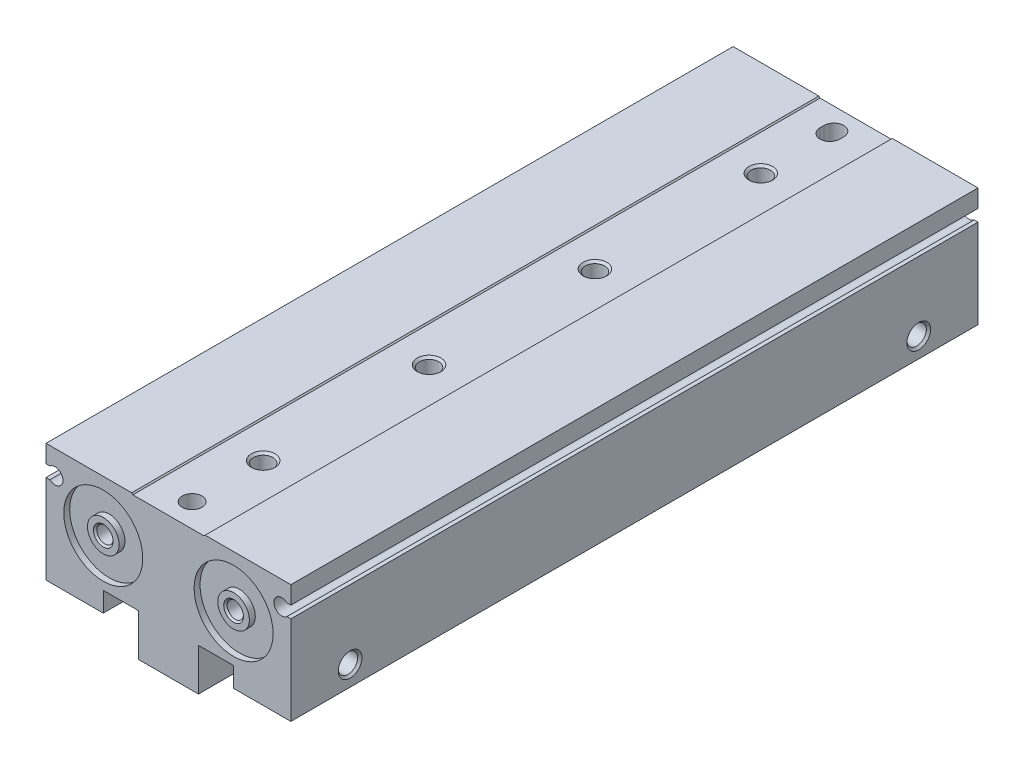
ISO-10303-21;
HEADER;
FILE_DESCRIPTION(('STEP AP214'),'2;1');
FILE_NAME('part.step','',(''),(''),'','','');
FILE_SCHEMA(('AUTOMOTIVE_DESIGN { 1 0 10303 214 1 1 1 1 }'));
ENDSEC;
DATA;
#1=APPLICATION_CONTEXT('core data for automotive mechanical design processes');
#2=APPLICATION_PROTOCOL_DEFINITION('international standard','automotive_design',2000,#1);
#3=PRODUCT_CONTEXT('',#1,'mechanical');
#4=PRODUCT('Part','Part','',(#3));
#5=PRODUCT_RELATED_PRODUCT_CATEGORY('part','',(#4));
#6=PRODUCT_DEFINITION_FORMATION('','',#4);
#7=PRODUCT_DEFINITION_CONTEXT('part definition',#1,'design');
#8=PRODUCT_DEFINITION('design','',#6,#7);
#9=PRODUCT_DEFINITION_SHAPE('','',#8);
#10=(LENGTH_UNIT() NAMED_UNIT(*) SI_UNIT(.MILLI.,.METRE.));
#11=(NAMED_UNIT(*) PLANE_ANGLE_UNIT() SI_UNIT($,.RADIAN.));
#12=(NAMED_UNIT(*) SI_UNIT($,.STERADIAN.) SOLID_ANGLE_UNIT());
#13=UNCERTAINTY_MEASURE_WITH_UNIT(LENGTH_MEASURE(1.E-05),#10,'distance_accuracy_value','');
#14=(GEOMETRIC_REPRESENTATION_CONTEXT(3) GLOBAL_UNCERTAINTY_ASSIGNED_CONTEXT((#13)) GLOBAL_UNIT_ASSIGNED_CONTEXT((#10,
#11,#12)) REPRESENTATION_CONTEXT('',''));
#15=CARTESIAN_POINT('',(0.,0.,0.));
#16=DIRECTION('',(0.,0.,1.));
#17=DIRECTION('',(1.,0.,0.));
#18=AXIS2_PLACEMENT_3D('',#15,#16,#17);
#19=CARTESIAN_POINT('',(7.6,-25.,-25.8));
#20=DIRECTION('',(0.,-1.,0.));
#21=DIRECTION('',(1.,0.,0.));
#22=AXIS2_PLACEMENT_3D('',#19,#20,#21);
#23=PLANE('',#22);
#24=DIRECTION('',(1.,0.,0.));
#25=VECTOR('',#24,1.);
#26=CARTESIAN_POINT('',(7.6,-25.,-25.8));
#27=LINE('',#26,#25);
#28=CARTESIAN_POINT('',(7.6,-25.,-25.8));
#29=VERTEX_POINT('',#28);
#30=CARTESIAN_POINT('',(16.5,-25.,-25.8));
#31=VERTEX_POINT('',#30);
#32=EDGE_CURVE('E251',#29,#31,#27,.T.);
#33=ORIENTED_EDGE('',*,*,#32,.T.);
#34=DIRECTION('',(0.,0.,1.));
#35=VECTOR('',#34,1.);
#36=CARTESIAN_POINT('',(16.5,-25.,-25.8));
#37=LINE('',#36,#35);
#38=CARTESIAN_POINT('',(16.5,-25.,87.));
#39=VERTEX_POINT('',#38);
#40=EDGE_CURVE('E264',#39,#31,#37,.F.);
#41=ORIENTED_EDGE('',*,*,#40,.F.);
#42=DIRECTION('',(-1.,0.,0.));
#43=VECTOR('',#42,1.);
#44=CARTESIAN_POINT('',(16.5,-25.,87.));
#45=LINE('',#44,#43);
#46=CARTESIAN_POINT('',(7.6,-25.,87.));
#47=VERTEX_POINT('',#46);
#48=EDGE_CURVE('E272',#47,#39,#45,.F.);
#49=ORIENTED_EDGE('',*,*,#48,.F.);
#50=DIRECTION('',(0.,0.,-1.));
#51=VECTOR('',#50,1.);
#52=CARTESIAN_POINT('',(7.6,-25.,87.));
#53=LINE('',#52,#51);
#54=EDGE_CURVE('E266',#47,#29,#53,.T.);
#55=ORIENTED_EDGE('',*,*,#54,.T.);
#56=EDGE_LOOP('',(#33,#41,#49,#55));
#57=FACE_BOUND('',#56,.T.);
#58=ADVANCED_FACE('F16',(#57),#23,.T.);
#59=CARTESIAN_POINT('',(7.6,-25.,-87.));
#60=DIRECTION('',(0.,-1.,0.));
#61=DIRECTION('',(1.,0.,0.));
#62=AXIS2_PLACEMENT_3D('',#59,#60,#61);
#63=PLANE('',#62);
#64=DIRECTION('',(-1.,0.,0.));
#65=VECTOR('',#64,1.);
#66=CARTESIAN_POINT('',(16.5,-25.,-66.8));
#67=LINE('',#66,#65);
#68=CARTESIAN_POINT('',(16.5,-25.,-66.8));
#69=VERTEX_POINT('',#68);
#70=CARTESIAN_POINT('',(7.6,-25.,-66.8));
#71=VERTEX_POINT('',#70);
#72=EDGE_CURVE('E283',#69,#71,#67,.T.);
#73=ORIENTED_EDGE('',*,*,#72,.T.);
#74=DIRECTION('',(0.,0.,-1.));
#75=VECTOR('',#74,1.);
#76=CARTESIAN_POINT('',(7.6,-25.,-66.8));
#77=LINE('',#76,#75);
#78=CARTESIAN_POINT('',(7.6,-25.,-87.));
#79=VERTEX_POINT('',#78);
#80=EDGE_CURVE('E288',#71,#79,#77,.T.);
#81=ORIENTED_EDGE('',*,*,#80,.T.);
#82=DIRECTION('',(1.,0.,0.));
#83=VECTOR('',#82,1.);
#84=CARTESIAN_POINT('',(7.6,-25.,-87.));
#85=LINE('',#84,#83);
#86=CARTESIAN_POINT('',(16.5,-25.,-87.));
#87=VERTEX_POINT('',#86);
#88=EDGE_CURVE('E293',#79,#87,#85,.T.);
#89=ORIENTED_EDGE('',*,*,#88,.T.);
#90=DIRECTION('',(0.,0.,1.));
#91=VECTOR('',#90,1.);
#92=CARTESIAN_POINT('',(16.5,-25.,-87.));
#93=LINE('',#92,#91);
#94=EDGE_CURVE('E298',#69,#87,#93,.F.);
#95=ORIENTED_EDGE('',*,*,#94,.F.);
#96=EDGE_LOOP('',(#73,#81,#89,#95));
#97=FACE_BOUND('',#96,.T.);
#98=ADVANCED_FACE('F990',(#97),#63,.T.);
#99=CARTESIAN_POINT('',(-16.5,-25.,66.8));
#100=DIRECTION('',(0.,-1.,0.));
#101=DIRECTION('',(1.,0.,0.));
#102=AXIS2_PLACEMENT_3D('',#99,#100,#101);
#103=PLANE('',#102);
#104=DIRECTION('',(1.,0.,0.));
#105=VECTOR('',#104,1.);
#106=CARTESIAN_POINT('',(-16.5,-25.,66.8));
#107=LINE('',#106,#105);
#108=CARTESIAN_POINT('',(-16.5,-25.,66.8));
#109=VERTEX_POINT('',#108);
#110=CARTESIAN_POINT('',(-7.6,-25.,66.8));
#111=VERTEX_POINT('',#110);
#112=EDGE_CURVE('E303',#109,#111,#107,.T.);
#113=ORIENTED_EDGE('',*,*,#112,.T.);
#114=DIRECTION('',(0.,0.,1.));
#115=VECTOR('',#114,1.);
#116=CARTESIAN_POINT('',(-7.6,-25.,66.8));
#117=LINE('',#116,#115);
#118=CARTESIAN_POINT('',(-7.6,-25.,87.));
#119=VERTEX_POINT('',#118);
#120=EDGE_CURVE('E308',#119,#111,#117,.F.);
#121=ORIENTED_EDGE('',*,*,#120,.F.);
#122=DIRECTION('',(-1.,0.,0.));
#123=VECTOR('',#122,1.);
#124=CARTESIAN_POINT('',(-7.6,-25.,87.));
#125=LINE('',#124,#123);
#126=CARTESIAN_POINT('',(-16.5,-25.,87.));
#127=VERTEX_POINT('',#126);
#128=EDGE_CURVE('E313',#127,#119,#125,.F.);
#129=ORIENTED_EDGE('',*,*,#128,.F.);
#130=DIRECTION('',(0.,0.,-1.));
#131=VECTOR('',#130,1.);
#132=CARTESIAN_POINT('',(-16.5,-25.,87.));
#133=LINE('',#132,#131);
#134=EDGE_CURVE('E317',#127,#109,#133,.T.);
#135=ORIENTED_EDGE('',*,*,#134,.T.);
#136=EDGE_LOOP('',(#113,#121,#129,#135));
#137=FACE_BOUND('',#136,.T.);
#138=ADVANCED_FACE('F995',(#137),#103,.T.);
#139=CARTESIAN_POINT('',(-16.5,-25.,-87.));
#140=DIRECTION('',(0.,-1.,0.));
#141=DIRECTION('',(1.,0.,0.));
#142=AXIS2_PLACEMENT_3D('',#139,#140,#141);
#143=PLANE('',#142);
#144=DIRECTION('',(-1.,0.,0.));
#145=VECTOR('',#144,1.);
#146=CARTESIAN_POINT('',(-7.6,-25.,25.8));
#147=LINE('',#146,#145);
#148=CARTESIAN_POINT('',(-7.6,-25.,25.8));
#149=VERTEX_POINT('',#148);
#150=CARTESIAN_POINT('',(-16.5,-25.,25.8));
#151=VERTEX_POINT('',#150);
#152=EDGE_CURVE('E322',#149,#151,#147,.T.);
#153=ORIENTED_EDGE('',*,*,#152,.T.);
#154=DIRECTION('',(0.,0.,-1.));
#155=VECTOR('',#154,1.);
#156=CARTESIAN_POINT('',(-16.5,-25.,25.8));
#157=LINE('',#156,#155);
#158=CARTESIAN_POINT('',(-16.5,-25.,-87.));
#159=VERTEX_POINT('',#158);
#160=EDGE_CURVE('E327',#151,#159,#157,.T.);
#161=ORIENTED_EDGE('',*,*,#160,.T.);
#162=DIRECTION('',(1.,0.,0.));
#163=VECTOR('',#162,1.);
#164=CARTESIAN_POINT('',(-16.5,-25.,-87.));
#165=LINE('',#164,#163);
#166=CARTESIAN_POINT('',(-7.6,-25.,-87.));
#167=VERTEX_POINT('',#166);
#168=EDGE_CURVE('E332',#159,#167,#165,.T.);
#169=ORIENTED_EDGE('',*,*,#168,.T.);
#170=DIRECTION('',(0.,0.,1.));
#171=VECTOR('',#170,1.);
#172=CARTESIAN_POINT('',(-7.6,-25.,-87.));
#173=LINE('',#172,#171);
#174=EDGE_CURVE('E337',#149,#167,#173,.F.);
#175=ORIENTED_EDGE('',*,*,#174,.F.);
#176=EDGE_LOOP('',(#153,#161,#169,#175));
#177=FACE_BOUND('',#176,.T.);
#178=ADVANCED_FACE('F1001',(#177),#143,.T.);
#179=CARTESIAN_POINT('',(-31.,-7.5,87.));
#180=DIRECTION('',(0.,1.,0.));
#181=DIRECTION('',(1.,0.,0.));
#182=AXIS2_PLACEMENT_3D('',#179,#180,#181);
#183=PLANE('',#182);
#184=DIRECTION('',(-1.,0.,0.));
#185=VECTOR('',#184,1.);
#186=CARTESIAN_POINT('',(-30.022875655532,-7.5,-87.));
#187=LINE('',#186,#185);
#188=CARTESIAN_POINT('',(-30.022875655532,-7.5,-87.));
#189=VERTEX_POINT('',#188);
#190=CARTESIAN_POINT('',(-31.,-7.5,-87.));
#191=VERTEX_POINT('',#190);
#192=EDGE_CURVE('E342',#189,#191,#187,.T.);
#193=ORIENTED_EDGE('',*,*,#192,.T.);
#194=DIRECTION('',(0.,0.,1.));
#195=VECTOR('',#194,1.);
#196=CARTESIAN_POINT('',(-31.,-7.5,-87.));
#197=LINE('',#196,#195);
#198=CARTESIAN_POINT('',(-31.,-7.5,87.));
#199=VERTEX_POINT('',#198);
#200=EDGE_CURVE('E347',#199,#191,#197,.F.);
#201=ORIENTED_EDGE('',*,*,#200,.F.);
#202=DIRECTION('',(1.,0.,0.));
#203=VECTOR('',#202,1.);
#204=CARTESIAN_POINT('',(-31.,-7.5,87.));
#205=LINE('',#204,#203);
#206=CARTESIAN_POINT('',(-30.022875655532,-7.5,87.));
#207=VERTEX_POINT('',#206);
#208=EDGE_CURVE('E352',#207,#199,#205,.F.);
#209=ORIENTED_EDGE('',*,*,#208,.F.);
#210=DIRECTION('',(0.,0.,-1.));
#211=VECTOR('',#210,1.);
#212=CARTESIAN_POINT('',(-30.022875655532,-7.5,87.));
#213=LINE('',#212,#211);
#214=EDGE_CURVE('E356',#207,#189,#213,.T.);
#215=ORIENTED_EDGE('',*,*,#214,.T.);
#216=EDGE_LOOP('',(#193,#201,#209,#215));
#217=FACE_BOUND('',#216,.T.);
#218=ADVANCED_FACE('F1005',(#217),#183,.T.);
#219=CARTESIAN_POINT('',(-31.,-30.,87.));
#220=DIRECTION('',(-1.,0.,0.));
#221=DIRECTION('',(0.,1.,0.));
#222=AXIS2_PLACEMENT_3D('',#219,#220,#221);
#223=PLANE('',#222);
#224=DIRECTION('',(0.,-1.,0.));
#225=VECTOR('',#224,1.);
#226=CARTESIAN_POINT('',(-31.,-7.5,-87.));
#227=LINE('',#226,#225);
#228=CARTESIAN_POINT('',(-31.,-30.,-87.));
#229=VERTEX_POINT('',#228);
#230=EDGE_CURVE('E361',#191,#229,#227,.T.);
#231=ORIENTED_EDGE('',*,*,#230,.T.);
#232=DIRECTION('',(0.,0.,1.));
#233=VECTOR('',#232,1.);
#234=CARTESIAN_POINT('',(-31.,-30.,-87.));
#235=LINE('',#234,#233);
#236=CARTESIAN_POINT('',(-31.,-30.,87.));
#237=VERTEX_POINT('',#236);
#238=EDGE_CURVE('E366',#237,#229,#235,.F.);
#239=ORIENTED_EDGE('',*,*,#238,.F.);
#240=DIRECTION('',(0.,1.,0.));
#241=VECTOR('',#240,1.);
#242=CARTESIAN_POINT('',(-31.,-30.,87.));
#243=LINE('',#242,#241);
#244=EDGE_CURVE('E371',#199,#237,#243,.F.);
#245=ORIENTED_EDGE('',*,*,#244,.F.);
#246=ORIENTED_EDGE('',*,*,#200,.T.);
#247=EDGE_LOOP('',(#231,#239,#245,#246));
#248=FACE_BOUND('',#247,.T.);
#249=CARTESIAN_POINT('',(-31.,-25.,-72.));
#250=DIRECTION('',(1.,0.,0.));
#251=DIRECTION('',(0.,0.,1.));
#252=AXIS2_PLACEMENT_3D('',#249,#250,#251);
#253=CIRCLE('',#252,3.);
#254=CARTESIAN_POINT('',(-31.,-25.,-69.));
#255=VERTEX_POINT('',#254);
#256=EDGE_CURVE('E375',#255,#255,#253,.F.);
#257=ORIENTED_EDGE('',*,*,#256,.F.);
#258=EDGE_LOOP('',(#257));
#259=FACE_BOUND('',#258,.T.);
#260=CARTESIAN_POINT('',(-31.,-25.,72.));
#261=DIRECTION('',(1.,0.,0.));
#262=DIRECTION('',(0.,0.,1.));
#263=AXIS2_PLACEMENT_3D('',#260,#261,#262);
#264=CIRCLE('',#263,3.);
#265=CARTESIAN_POINT('',(-31.,-25.,75.));
#266=VERTEX_POINT('',#265);
#267=EDGE_CURVE('E380',#266,#266,#264,.F.);
#268=ORIENTED_EDGE('',*,*,#267,.F.);
#269=EDGE_LOOP('',(#268));
#270=FACE_BOUND('',#269,.T.);
#271=ADVANCED_FACE('F1009',(#248,#259,#270),#223,.T.);
#272=CARTESIAN_POINT('',(-31.,-30.,-87.));
#273=DIRECTION('',(0.,-1.,0.));
#274=DIRECTION('',(1.,0.,0.));
#275=AXIS2_PLACEMENT_3D('',#272,#273,#274);
#276=PLANE('',#275);
#277=DIRECTION('',(1.,0.,0.));
#278=VECTOR('',#277,1.);
#279=CARTESIAN_POINT('',(-31.,-30.,-87.));
#280=LINE('',#279,#278);
#281=CARTESIAN_POINT('',(-16.5,-30.,-87.));
#282=VERTEX_POINT('',#281);
#283=EDGE_CURVE('E383',#229,#282,#280,.T.);
#284=ORIENTED_EDGE('',*,*,#283,.T.);
#285=DIRECTION('',(0.,0.,1.));
#286=VECTOR('',#285,1.);
#287=CARTESIAN_POINT('',(-16.5,-30.,-87.));
#288=LINE('',#287,#286);
#289=CARTESIAN_POINT('',(-16.5,-30.,87.));
#290=VERTEX_POINT('',#289);
#291=EDGE_CURVE('E386',#290,#282,#288,.F.);
#292=ORIENTED_EDGE('',*,*,#291,.F.);
#293=DIRECTION('',(-1.,0.,0.));
#294=VECTOR('',#293,1.);
#295=CARTESIAN_POINT('',(-16.5,-30.,87.));
#296=LINE('',#295,#294);
#297=EDGE_CURVE('E391',#237,#290,#296,.F.);
#298=ORIENTED_EDGE('',*,*,#297,.F.);
#299=ORIENTED_EDGE('',*,*,#238,.T.);
#300=EDGE_LOOP('',(#284,#292,#298,#299));
#301=FACE_BOUND('',#300,.T.);
#302=CARTESIAN_POINT('',(-26.,-30.,64.));
#303=DIRECTION('',(0.,1.,0.));
#304=DIRECTION('',(-1.42053988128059E-07,0.,-0.99999999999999));
#305=AXIS2_PLACEMENT_3D('',#302,#303,#304);
#306=CIRCLE('',#305,3.);
#307=CARTESIAN_POINT('',(-26.000000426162,-30.,61.));
#308=VERTEX_POINT('',#307);
#309=EDGE_CURVE('E395',#308,#308,#306,.T.);
#310=ORIENTED_EDGE('',*,*,#309,.T.);
#311=EDGE_LOOP('',(#310));
#312=FACE_BOUND('',#311,.T.);
#313=CARTESIAN_POINT('',(-26.,-30.,-64.));
#314=DIRECTION('',(0.,1.,0.));
#315=DIRECTION('',(-1.42053986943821E-07,0.,-0.99999999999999));
#316=AXIS2_PLACEMENT_3D('',#313,#314,#315);
#317=CIRCLE('',#316,3.);
#318=CARTESIAN_POINT('',(-26.000000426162,-30.,-67.));
#319=VERTEX_POINT('',#318);
#320=EDGE_CURVE('E400',#319,#319,#317,.T.);
#321=ORIENTED_EDGE('',*,*,#320,.T.);
#322=EDGE_LOOP('',(#321));
#323=FACE_BOUND('',#322,.T.);
#324=ADVANCED_FACE('F1013',(#301,#312,#323),#276,.T.);
#325=CARTESIAN_POINT('',(-16.5,-30.,-87.));
#326=DIRECTION('',(1.,0.,0.));
#327=DIRECTION('',(0.,1.,0.));
#328=AXIS2_PLACEMENT_3D('',#325,#326,#327);
#329=PLANE('',#328);
#330=DIRECTION('',(0.,1.,0.));
#331=VECTOR('',#330,1.);
#332=CARTESIAN_POINT('',(-16.5,-30.,-87.));
#333=LINE('',#332,#331);
#334=EDGE_CURVE('E403',#282,#159,#333,.T.);
#335=ORIENTED_EDGE('',*,*,#334,.T.);
#336=ORIENTED_EDGE('',*,*,#160,.F.);
#337=DIRECTION('',(0.,1.,0.));
#338=VECTOR('',#337,1.);
#339=CARTESIAN_POINT('',(-16.5,-25.,25.8));
#340=LINE('',#339,#338);
#341=CARTESIAN_POINT('',(-16.5,-23.4,25.8));
#342=VERTEX_POINT('',#341);
#343=EDGE_CURVE('E406',#342,#151,#340,.F.);
#344=ORIENTED_EDGE('',*,*,#343,.F.);
#345=DIRECTION('',(0.,0.,1.));
#346=VECTOR('',#345,1.);
#347=CARTESIAN_POINT('',(-16.5,-23.4,25.8));
#348=LINE('',#347,#346);
#349=CARTESIAN_POINT('',(-16.5,-23.4,66.8));
#350=VERTEX_POINT('',#349);
#351=EDGE_CURVE('E410',#342,#350,#348,.T.);
#352=ORIENTED_EDGE('',*,*,#351,.T.);
#353=DIRECTION('',(0.,-1.,0.));
#354=VECTOR('',#353,1.);
#355=CARTESIAN_POINT('',(-16.5,-23.4,66.8));
#356=LINE('',#355,#354);
#357=EDGE_CURVE('E415',#350,#109,#356,.T.);
#358=ORIENTED_EDGE('',*,*,#357,.T.);
#359=ORIENTED_EDGE('',*,*,#134,.F.);
#360=DIRECTION('',(0.,-1.,0.));
#361=VECTOR('',#360,1.);
#362=CARTESIAN_POINT('',(-16.5,-25.,87.));
#363=LINE('',#362,#361);
#364=EDGE_CURVE('E420',#290,#127,#363,.F.);
#365=ORIENTED_EDGE('',*,*,#364,.F.);
#366=ORIENTED_EDGE('',*,*,#291,.T.);
#367=EDGE_LOOP('',(#335,#336,#344,#352,#358,#359,#365,#366));
#368=FACE_BOUND('',#367,.T.);
#369=ADVANCED_FACE('F1017',(#368),#329,.T.);
#370=CARTESIAN_POINT('',(-7.6,-35.7,87.));
#371=DIRECTION('',(-1.,0.,0.));
#372=DIRECTION('',(0.,1.,0.));
#373=AXIS2_PLACEMENT_3D('',#370,#371,#372);
#374=PLANE('',#373);
#375=DIRECTION('',(0.,-1.,0.));
#376=VECTOR('',#375,1.);
#377=CARTESIAN_POINT('',(-7.6,-25.,-87.));
#378=LINE('',#377,#376);
#379=CARTESIAN_POINT('',(-7.6,-35.7,-87.));
#380=VERTEX_POINT('',#379);
#381=EDGE_CURVE('E424',#167,#380,#378,.T.);
#382=ORIENTED_EDGE('',*,*,#381,.T.);
#383=DIRECTION('',(0.,0.,1.));
#384=VECTOR('',#383,1.);
#385=CARTESIAN_POINT('',(-7.6,-35.7,-87.));
#386=LINE('',#385,#384);
#387=CARTESIAN_POINT('',(-7.6,-35.7,87.));
#388=VERTEX_POINT('',#387);
#389=EDGE_CURVE('E429',#388,#380,#386,.F.);
#390=ORIENTED_EDGE('',*,*,#389,.F.);
#391=DIRECTION('',(0.,1.,0.));
#392=VECTOR('',#391,1.);
#393=CARTESIAN_POINT('',(-7.6,-35.7,87.));
#394=LINE('',#393,#392);
#395=EDGE_CURVE('E434',#119,#388,#394,.F.);
#396=ORIENTED_EDGE('',*,*,#395,.F.);
#397=ORIENTED_EDGE('',*,*,#120,.T.);
#398=DIRECTION('',(0.,1.,0.));
#399=VECTOR('',#398,1.);
#400=CARTESIAN_POINT('',(-7.6,-25.,66.8));
#401=LINE('',#400,#399);
#402=CARTESIAN_POINT('',(-7.6,-23.4,66.8));
#403=VERTEX_POINT('',#402);
#404=EDGE_CURVE('E438',#403,#111,#401,.F.);
#405=ORIENTED_EDGE('',*,*,#404,.F.);
#406=DIRECTION('',(0.,0.,-1.));
#407=VECTOR('',#406,1.);
#408=CARTESIAN_POINT('',(-7.6,-23.4,66.8));
#409=LINE('',#408,#407);
#410=CARTESIAN_POINT('',(-7.6,-23.4,25.8));
#411=VERTEX_POINT('',#410);
#412=EDGE_CURVE('E442',#403,#411,#409,.T.);
#413=ORIENTED_EDGE('',*,*,#412,.T.);
#414=DIRECTION('',(0.,-1.,0.));
#415=VECTOR('',#414,1.);
#416=CARTESIAN_POINT('',(-7.6,-23.4,25.8));
#417=LINE('',#416,#415);
#418=EDGE_CURVE('E447',#411,#149,#417,.T.);
#419=ORIENTED_EDGE('',*,*,#418,.T.);
#420=ORIENTED_EDGE('',*,*,#174,.T.);
#421=EDGE_LOOP('',(#382,#390,#396,#397,#405,#413,#419,#420));
#422=FACE_BOUND('',#421,.T.);
#423=ADVANCED_FACE('F1021',(#422),#374,.T.);
#424=CARTESIAN_POINT('',(-7.6,-35.7,-87.));
#425=DIRECTION('',(0.,-1.,0.));
#426=DIRECTION('',(1.,0.,0.));
#427=AXIS2_PLACEMENT_3D('',#424,#425,#426);
#428=PLANE('',#427);
#429=DIRECTION('',(1.,0.,0.));
#430=VECTOR('',#429,1.);
#431=CARTESIAN_POINT('',(-7.6,-35.7,-87.));
#432=LINE('',#431,#430);
#433=CARTESIAN_POINT('',(7.6,-35.7,-87.));
#434=VERTEX_POINT('',#433);
#435=EDGE_CURVE('E452',#380,#434,#432,.T.);
#436=ORIENTED_EDGE('',*,*,#435,.T.);
#437=DIRECTION('',(0.,0.,1.));
#438=VECTOR('',#437,1.);
#439=CARTESIAN_POINT('',(7.6,-35.7,-87.));
#440=LINE('',#439,#438);
#441=CARTESIAN_POINT('',(7.6,-35.7,87.));
#442=VERTEX_POINT('',#441);
#443=EDGE_CURVE('E457',#442,#434,#440,.F.);
#444=ORIENTED_EDGE('',*,*,#443,.F.);
#445=DIRECTION('',(-1.,0.,0.));
#446=VECTOR('',#445,1.);
#447=CARTESIAN_POINT('',(7.6,-35.7,87.));
#448=LINE('',#447,#446);
#449=EDGE_CURVE('E462',#388,#442,#448,.F.);
#450=ORIENTED_EDGE('',*,*,#449,.F.);
#451=ORIENTED_EDGE('',*,*,#389,.T.);
#452=EDGE_LOOP('',(#436,#444,#450,#451));
#453=FACE_BOUND('',#452,.T.);
#454=CARTESIAN_POINT('',(0.,-35.7,21.));
#455=DIRECTION('',(0.,1.,0.));
#456=DIRECTION('',(0.,0.,-1.));
#457=AXIS2_PLACEMENT_3D('',#454,#455,#456);
#458=CIRCLE('',#457,5.);
#459=CARTESIAN_POINT('',(0.,-35.7,16.));
#460=VERTEX_POINT('',#459);
#461=EDGE_CURVE('E466',#460,#460,#458,.F.);
#462=ORIENTED_EDGE('',*,*,#461,.F.);
#463=EDGE_LOOP('',(#462));
#464=FACE_BOUND('',#463,.T.);
#465=CARTESIAN_POINT('',(0.,-35.7,63.));
#466=DIRECTION('',(0.,1.,0.));
#467=DIRECTION('',(0.,0.,-1.));
#468=AXIS2_PLACEMENT_3D('',#465,#466,#467);
#469=CIRCLE('',#468,5.);
#470=CARTESIAN_POINT('',(0.,-35.7,58.));
#471=VERTEX_POINT('',#470);
#472=EDGE_CURVE('E471',#471,#471,#469,.F.);
#473=ORIENTED_EDGE('',*,*,#472,.F.);
#474=EDGE_LOOP('',(#473));
#475=FACE_BOUND('',#474,.T.);
#476=CARTESIAN_POINT('',(0.,-35.7,-63.));
#477=DIRECTION('',(0.,1.,0.));
#478=DIRECTION('',(0.,0.,-1.));
#479=AXIS2_PLACEMENT_3D('',#476,#477,#478);
#480=CIRCLE('',#479,5.);
#481=CARTESIAN_POINT('',(0.,-35.7,-68.));
#482=VERTEX_POINT('',#481);
#483=EDGE_CURVE('E474',#482,#482,#480,.F.);
#484=ORIENTED_EDGE('',*,*,#483,.F.);
#485=EDGE_LOOP('',(#484));
#486=FACE_BOUND('',#485,.T.);
#487=CARTESIAN_POINT('',(0.,-35.7,-21.));
#488=DIRECTION('',(0.,1.,0.));
#489=DIRECTION('',(0.,0.,-1.));
#490=AXIS2_PLACEMENT_3D('',#487,#488,#489);
#491=CIRCLE('',#490,5.);
#492=CARTESIAN_POINT('',(0.,-35.7,-26.));
#493=VERTEX_POINT('',#492);
#494=EDGE_CURVE('E477',#493,#493,#491,.F.);
#495=ORIENTED_EDGE('',*,*,#494,.F.);
#496=EDGE_LOOP('',(#495));
#497=FACE_BOUND('',#496,.T.);
#498=ADVANCED_FACE('F1025',(#453,#464,#475,#486,#497),#428,.T.);
#499=CARTESIAN_POINT('',(7.6,-35.7,-87.));
#500=DIRECTION('',(1.,0.,0.));
#501=DIRECTION('',(0.,1.,0.));
#502=AXIS2_PLACEMENT_3D('',#499,#500,#501);
#503=PLANE('',#502);
#504=DIRECTION('',(0.,1.,0.));
#505=VECTOR('',#504,1.);
#506=CARTESIAN_POINT('',(7.6,-35.7,-87.));
#507=LINE('',#506,#505);
#508=EDGE_CURVE('E480',#434,#79,#507,.T.);
#509=ORIENTED_EDGE('',*,*,#508,.T.);
#510=ORIENTED_EDGE('',*,*,#80,.F.);
#511=DIRECTION('',(0.,1.,0.));
#512=VECTOR('',#511,1.);
#513=CARTESIAN_POINT('',(7.6,-25.,-66.8));
#514=LINE('',#513,#512);
#515=CARTESIAN_POINT('',(7.6,-23.4,-66.8));
#516=VERTEX_POINT('',#515);
#517=EDGE_CURVE('E483',#516,#71,#514,.F.);
#518=ORIENTED_EDGE('',*,*,#517,.F.);
#519=DIRECTION('',(0.,0.,1.));
#520=VECTOR('',#519,1.);
#521=CARTESIAN_POINT('',(7.6,-23.4,-66.8));
#522=LINE('',#521,#520);
#523=CARTESIAN_POINT('',(7.6,-23.4,-25.8));
#524=VERTEX_POINT('',#523);
#525=EDGE_CURVE('E487',#516,#524,#522,.T.);
#526=ORIENTED_EDGE('',*,*,#525,.T.);
#527=DIRECTION('',(0.,-1.,0.));
#528=VECTOR('',#527,1.);
#529=CARTESIAN_POINT('',(7.6,-23.4,-25.8));
#530=LINE('',#529,#528);
#531=EDGE_CURVE('E492',#524,#29,#530,.T.);
#532=ORIENTED_EDGE('',*,*,#531,.T.);
#533=ORIENTED_EDGE('',*,*,#54,.F.);
#534=DIRECTION('',(0.,-1.,0.));
#535=VECTOR('',#534,1.);
#536=CARTESIAN_POINT('',(7.6,-25.,87.));
#537=LINE('',#536,#535);
#538=EDGE_CURVE('E496',#442,#47,#537,.F.);
#539=ORIENTED_EDGE('',*,*,#538,.F.);
#540=ORIENTED_EDGE('',*,*,#443,.T.);
#541=EDGE_LOOP('',(#509,#510,#518,#526,#532,#533,#539,#540));
#542=FACE_BOUND('',#541,.T.);
#543=ADVANCED_FACE('F1029',(#542),#503,.T.);
#544=CARTESIAN_POINT('',(16.5,-30.,87.));
#545=DIRECTION('',(-1.,0.,0.));
#546=DIRECTION('',(0.,1.,0.));
#547=AXIS2_PLACEMENT_3D('',#544,#545,#546);
#548=PLANE('',#547);
#549=DIRECTION('',(0.,-1.,0.));
#550=VECTOR('',#549,1.);
#551=CARTESIAN_POINT('',(16.5,-25.,-87.));
#552=LINE('',#551,#550);
#553=CARTESIAN_POINT('',(16.5,-30.,-87.));
#554=VERTEX_POINT('',#553);
#555=EDGE_CURVE('E500',#87,#554,#552,.T.);
#556=ORIENTED_EDGE('',*,*,#555,.T.);
#557=DIRECTION('',(0.,0.,1.));
#558=VECTOR('',#557,1.);
#559=CARTESIAN_POINT('',(16.5,-30.,-87.));
#560=LINE('',#559,#558);
#561=CARTESIAN_POINT('',(16.5,-30.,87.));
#562=VERTEX_POINT('',#561);
#563=EDGE_CURVE('E504',#562,#554,#560,.F.);
#564=ORIENTED_EDGE('',*,*,#563,.F.);
#565=DIRECTION('',(0.,1.,0.));
#566=VECTOR('',#565,1.);
#567=CARTESIAN_POINT('',(16.5,-30.,87.));
#568=LINE('',#567,#566);
#569=EDGE_CURVE('E258',#39,#562,#568,.F.);
#570=ORIENTED_EDGE('',*,*,#569,.F.);
#571=ORIENTED_EDGE('',*,*,#40,.T.);
#572=DIRECTION('',(0.,1.,0.));
#573=VECTOR('',#572,1.);
#574=CARTESIAN_POINT('',(16.5,-25.,-25.8));
#575=LINE('',#574,#573);
#576=CARTESIAN_POINT('',(16.5,-23.4,-25.8));
#577=VERTEX_POINT('',#576);
#578=EDGE_CURVE('E247',#577,#31,#575,.F.);
#579=ORIENTED_EDGE('',*,*,#578,.F.);
#580=DIRECTION('',(0.,0.,-1.));
#581=VECTOR('',#580,1.);
#582=CARTESIAN_POINT('',(16.5,-23.4,-25.8));
#583=LINE('',#582,#581);
#584=CARTESIAN_POINT('',(16.5,-23.4,-66.8));
#585=VERTEX_POINT('',#584);
#586=EDGE_CURVE('E257',#577,#585,#583,.T.);
#587=ORIENTED_EDGE('',*,*,#586,.T.);
#588=DIRECTION('',(0.,-1.,0.));
#589=VECTOR('',#588,1.);
#590=CARTESIAN_POINT('',(16.5,-23.4,-66.8));
#591=LINE('',#590,#589);
#592=EDGE_CURVE('E517',#585,#69,#591,.T.);
#593=ORIENTED_EDGE('',*,*,#592,.T.);
#594=ORIENTED_EDGE('',*,*,#94,.T.);
#595=EDGE_LOOP('',(#556,#564,#570,#571,#579,#587,#593,#594));
#596=FACE_BOUND('',#595,.T.);
#597=ADVANCED_FACE('F270',(#596),#548,.T.);
#598=CARTESIAN_POINT('',(16.5,-30.,-87.));
#599=DIRECTION('',(0.,-1.,0.));
#600=DIRECTION('',(1.,0.,0.));
#601=AXIS2_PLACEMENT_3D('',#598,#599,#600);
#602=PLANE('',#601);
#603=DIRECTION('',(1.,0.,0.));
#604=VECTOR('',#603,1.);
#605=CARTESIAN_POINT('',(16.5,-30.,-87.));
#606=LINE('',#605,#604);
#607=CARTESIAN_POINT('',(31.,-30.,-87.));
#608=VERTEX_POINT('',#607);
#609=EDGE_CURVE('E522',#554,#608,#606,.T.);
#610=ORIENTED_EDGE('',*,*,#609,.T.);
#611=DIRECTION('',(0.,0.,1.));
#612=VECTOR('',#611,1.);
#613=CARTESIAN_POINT('',(31.,-30.,-87.));
#614=LINE('',#613,#612);
#615=CARTESIAN_POINT('',(31.,-30.,87.));
#616=VERTEX_POINT('',#615);
#617=EDGE_CURVE('E527',#616,#608,#614,.F.);
#618=ORIENTED_EDGE('',*,*,#617,.F.);
#619=DIRECTION('',(-1.,0.,0.));
#620=VECTOR('',#619,1.);
#621=CARTESIAN_POINT('',(31.,-30.,87.));
#622=LINE('',#621,#620);
#623=EDGE_CURVE('E532',#562,#616,#622,.F.);
#624=ORIENTED_EDGE('',*,*,#623,.F.);
#625=ORIENTED_EDGE('',*,*,#563,.T.);
#626=EDGE_LOOP('',(#610,#618,#624,#625));
#627=FACE_BOUND('',#626,.T.);
#628=CARTESIAN_POINT('',(26.,-30.,-64.));
#629=DIRECTION('',(0.,1.,0.));
#630=DIRECTION('',(-1.42053986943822E-07,0.,-0.99999999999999));
#631=AXIS2_PLACEMENT_3D('',#628,#629,#630);
#632=CIRCLE('',#631,3.);
#633=CARTESIAN_POINT('',(25.999999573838,-30.,-67.));
#634=VERTEX_POINT('',#633);
#635=EDGE_CURVE('E536',#634,#634,#632,.T.);
#636=ORIENTED_EDGE('',*,*,#635,.T.);
#637=EDGE_LOOP('',(#636));
#638=FACE_BOUND('',#637,.T.);
#639=CARTESIAN_POINT('',(26.,-30.,64.));
#640=DIRECTION('',(0.,1.,0.));
#641=DIRECTION('',(-1.4205372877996E-07,0.,-0.99999999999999));
#642=AXIS2_PLACEMENT_3D('',#639,#640,#641);
#643=CIRCLE('',#642,3.);
#644=CARTESIAN_POINT('',(25.9999995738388,-30.,61.));
#645=VERTEX_POINT('',#644);
#646=EDGE_CURVE('E541',#645,#645,#643,.T.);
#647=ORIENTED_EDGE('',*,*,#646,.T.);
#648=EDGE_LOOP('',(#647));
#649=FACE_BOUND('',#648,.T.);
#650=ADVANCED_FACE('F1036',(#627,#638,#649),#602,.T.);
#651=CARTESIAN_POINT('',(31.,-30.,-87.));
#652=DIRECTION('',(1.,0.,0.));
#653=DIRECTION('',(0.,1.,0.));
#654=AXIS2_PLACEMENT_3D('',#651,#652,#653);
#655=PLANE('',#654);
#656=DIRECTION('',(0.,1.,0.));
#657=VECTOR('',#656,1.);
#658=CARTESIAN_POINT('',(31.,-30.,-87.));
#659=LINE('',#658,#657);
#660=CARTESIAN_POINT('',(31.,-7.50000000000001,-87.));
#661=VERTEX_POINT('',#660);
#662=EDGE_CURVE('E544',#608,#661,#659,.T.);
#663=ORIENTED_EDGE('',*,*,#662,.T.);
#664=DIRECTION('',(0.,0.,1.));
#665=VECTOR('',#664,1.);
#666=CARTESIAN_POINT('',(31.,-7.5,-87.));
#667=LINE('',#666,#665);
#668=CARTESIAN_POINT('',(31.,-7.5,87.));
#669=VERTEX_POINT('',#668);
#670=EDGE_CURVE('E547',#669,#661,#667,.F.);
#671=ORIENTED_EDGE('',*,*,#670,.F.);
#672=DIRECTION('',(0.,-1.,0.));
#673=VECTOR('',#672,1.);
#674=CARTESIAN_POINT('',(31.,-7.5,87.));
#675=LINE('',#674,#673);
#676=EDGE_CURVE('E552',#616,#669,#675,.F.);
#677=ORIENTED_EDGE('',*,*,#676,.F.);
#678=ORIENTED_EDGE('',*,*,#617,.T.);
#679=EDGE_LOOP('',(#663,#671,#677,#678));
#680=FACE_BOUND('',#679,.T.);
#681=CARTESIAN_POINT('',(31.,-25.,-72.));
#682=DIRECTION('',(-1.,0.,0.));
#683=DIRECTION('',(0.,-1.42053986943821E-07,-0.99999999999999));
#684=AXIS2_PLACEMENT_3D('',#681,#682,#683);
#685=CIRCLE('',#684,3.);
#686=CARTESIAN_POINT('',(31.,-25.000000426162,-75.));
#687=VERTEX_POINT('',#686);
#688=EDGE_CURVE('E556',#687,#687,#685,.T.);
#689=ORIENTED_EDGE('',*,*,#688,.T.);
#690=EDGE_LOOP('',(#689));
#691=FACE_BOUND('',#690,.T.);
#692=CARTESIAN_POINT('',(31.,-25.,72.));
#693=DIRECTION('',(-1.,0.,0.));
#694=DIRECTION('',(0.,-1.42053988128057E-07,-0.99999999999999));
#695=AXIS2_PLACEMENT_3D('',#692,#693,#694);
#696=CIRCLE('',#695,3.);
#697=CARTESIAN_POINT('',(31.,-25.000000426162,69.));
#698=VERTEX_POINT('',#697);
#699=EDGE_CURVE('E561',#698,#698,#696,.T.);
#700=ORIENTED_EDGE('',*,*,#699,.T.);
#701=EDGE_LOOP('',(#700));
#702=FACE_BOUND('',#701,.T.);
#703=ADVANCED_FACE('F1039',(#680,#691,#702),#655,.T.);
#704=CARTESIAN_POINT('',(30.022875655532,-7.5,87.));
#705=DIRECTION('',(0.,1.,0.));
#706=DIRECTION('',(1.,0.,0.));
#707=AXIS2_PLACEMENT_3D('',#704,#705,#706);
#708=PLANE('',#707);
#709=DIRECTION('',(-1.,0.,0.));
#710=VECTOR('',#709,1.);
#711=CARTESIAN_POINT('',(31.,-7.5,-87.));
#712=LINE('',#711,#710);
#713=CARTESIAN_POINT('',(30.022875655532,-7.5,-87.));
#714=VERTEX_POINT('',#713);
#715=EDGE_CURVE('E564',#661,#714,#712,.T.);
#716=ORIENTED_EDGE('',*,*,#715,.T.);
#717=DIRECTION('',(0.,0.,1.));
#718=VECTOR('',#717,1.);
#719=CARTESIAN_POINT('',(30.022875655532,-7.5,-87.));
#720=LINE('',#719,#718);
#721=CARTESIAN_POINT('',(30.022875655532,-7.5,87.));
#722=VERTEX_POINT('',#721);
#723=EDGE_CURVE('E567',#722,#714,#720,.F.);
#724=ORIENTED_EDGE('',*,*,#723,.F.);
#725=DIRECTION('',(1.,0.,0.));
#726=VECTOR('',#725,1.);
#727=CARTESIAN_POINT('',(30.022875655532,-7.5,87.));
#728=LINE('',#727,#726);
#729=EDGE_CURVE('E572',#669,#722,#728,.F.);
#730=ORIENTED_EDGE('',*,*,#729,.F.);
#731=ORIENTED_EDGE('',*,*,#670,.T.);
#732=EDGE_LOOP('',(#716,#724,#730,#731));
#733=FACE_BOUND('',#732,.T.);
#734=ADVANCED_FACE('F1043',(#733),#708,.T.);
#735=CARTESIAN_POINT('',(28.7,-6.,87.));
#736=DIRECTION('',(0.,0.,-1.));
#737=DIRECTION('',(0.661437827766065,-0.750000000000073,0.));
#738=AXIS2_PLACEMENT_3D('',#735,#736,#737);
#739=CYLINDRICAL_SURFACE('',#738,1.99999999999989);
#740=ORIENTED_EDGE('',*,*,#723,.T.);
#741=CARTESIAN_POINT('',(28.7,-6.,-87.));
#742=DIRECTION('',(0.,0.,-1.));
#743=DIRECTION('',(0.661437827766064,-0.750000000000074,0.));
#744=AXIS2_PLACEMENT_3D('',#741,#742,#743);
#745=CIRCLE('',#744,1.99999999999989);
#746=CARTESIAN_POINT('',(30.0228756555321,-4.49999999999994,-87.));
#747=VERTEX_POINT('',#746);
#748=EDGE_CURVE('E576',#747,#714,#745,.F.);
#749=ORIENTED_EDGE('',*,*,#748,.F.);
#750=DIRECTION('',(0.,0.,1.));
#751=VECTOR('',#750,1.);
#752=CARTESIAN_POINT('',(30.0228756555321,-4.49999999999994,-87.));
#753=LINE('',#752,#751);
#754=CARTESIAN_POINT('',(30.0228756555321,-4.49999999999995,87.));
#755=VERTEX_POINT('',#754);
#756=EDGE_CURVE('E580',#755,#747,#753,.F.);
#757=ORIENTED_EDGE('',*,*,#756,.F.);
#758=CARTESIAN_POINT('',(28.7,-6.,87.));
#759=DIRECTION('',(0.,0.,1.));
#760=DIRECTION('',(0.661437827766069,0.750000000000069,0.));
#761=AXIS2_PLACEMENT_3D('',#758,#759,#760);
#762=CIRCLE('',#761,1.99999999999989);
#763=EDGE_CURVE('E585',#755,#722,#762,.T.);
#764=ORIENTED_EDGE('',*,*,#763,.T.);
#765=EDGE_LOOP('',(#740,#749,#757,#764));
#766=FACE_BOUND('',#765,.T.);
#767=ADVANCED_FACE('F1047',(#766),#739,.F.);
#768=CARTESIAN_POINT('',(30.022875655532,-4.5,-87.));
#769=DIRECTION('',(0.,-1.,0.));
#770=DIRECTION('',(1.,0.,0.));
#771=AXIS2_PLACEMENT_3D('',#768,#769,#770);
#772=PLANE('',#771);
#773=DIRECTION('',(1.,0.,0.));
#774=VECTOR('',#773,1.);
#775=CARTESIAN_POINT('',(30.022875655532,-4.5,-87.));
#776=LINE('',#775,#774);
#777=CARTESIAN_POINT('',(31.,-4.5,-87.));
#778=VERTEX_POINT('',#777);
#779=EDGE_CURVE('E590',#747,#778,#776,.T.);
#780=ORIENTED_EDGE('',*,*,#779,.T.);
#781=DIRECTION('',(0.,0.,1.));
#782=VECTOR('',#781,1.);
#783=CARTESIAN_POINT('',(31.,-4.5,-87.));
#784=LINE('',#783,#782);
#785=CARTESIAN_POINT('',(31.,-4.5,87.));
#786=VERTEX_POINT('',#785);
#787=EDGE_CURVE('E595',#786,#778,#784,.F.);
#788=ORIENTED_EDGE('',*,*,#787,.F.);
#789=DIRECTION('',(-1.,0.,0.));
#790=VECTOR('',#789,1.);
#791=CARTESIAN_POINT('',(31.,-4.5,87.));
#792=LINE('',#791,#790);
#793=EDGE_CURVE('E600',#755,#786,#792,.F.);
#794=ORIENTED_EDGE('',*,*,#793,.F.);
#795=ORIENTED_EDGE('',*,*,#756,.T.);
#796=EDGE_LOOP('',(#780,#788,#794,#795));
#797=FACE_BOUND('',#796,.T.);
#798=ADVANCED_FACE('F1051',(#797),#772,.T.);
#799=CARTESIAN_POINT('',(31.,-4.5,-87.));
#800=DIRECTION('',(1.,0.,0.));
#801=DIRECTION('',(0.,1.,0.));
#802=AXIS2_PLACEMENT_3D('',#799,#800,#801);
#803=PLANE('',#802);
#804=DIRECTION('',(0.,1.,0.));
#805=VECTOR('',#804,1.);
#806=CARTESIAN_POINT('',(31.,-4.5,-87.));
#807=LINE('',#806,#805);
#808=CARTESIAN_POINT('',(31.,0.,-87.));
#809=VERTEX_POINT('',#808);
#810=EDGE_CURVE('E604',#778,#809,#807,.T.);
#811=ORIENTED_EDGE('',*,*,#810,.T.);
#812=DIRECTION('',(0.,0.,1.));
#813=VECTOR('',#812,1.);
#814=CARTESIAN_POINT('',(31.,0.,-87.));
#815=LINE('',#814,#813);
#816=CARTESIAN_POINT('',(31.,0.,87.));
#817=VERTEX_POINT('',#816);
#818=EDGE_CURVE('E609',#817,#809,#815,.F.);
#819=ORIENTED_EDGE('',*,*,#818,.F.);
#820=DIRECTION('',(0.,-1.,0.));
#821=VECTOR('',#820,1.);
#822=CARTESIAN_POINT('',(31.,0.,87.));
#823=LINE('',#822,#821);
#824=EDGE_CURVE('E614',#786,#817,#823,.F.);
#825=ORIENTED_EDGE('',*,*,#824,.F.);
#826=ORIENTED_EDGE('',*,*,#787,.T.);
#827=EDGE_LOOP('',(#811,#819,#825,#826));
#828=FACE_BOUND('',#827,.T.);
#829=ADVANCED_FACE('F1055',(#828),#803,.T.);
#830=CARTESIAN_POINT('',(9.3,0.,87.));
#831=DIRECTION('',(0.,1.,0.));
#832=DIRECTION('',(1.,0.,0.));
#833=AXIS2_PLACEMENT_3D('',#830,#831,#832);
#834=PLANE('',#833);
#835=DIRECTION('',(-1.,0.,0.));
#836=VECTOR('',#835,1.);
#837=CARTESIAN_POINT('',(31.,0.,-87.));
#838=LINE('',#837,#836);
#839=CARTESIAN_POINT('',(9.3,0.,-87.));
#840=VERTEX_POINT('',#839);
#841=EDGE_CURVE('E618',#809,#840,#838,.T.);
#842=ORIENTED_EDGE('',*,*,#841,.T.);
#843=DIRECTION('',(0.,0.,1.));
#844=VECTOR('',#843,1.);
#845=CARTESIAN_POINT('',(9.3,0.,-87.));
#846=LINE('',#845,#844);
#847=CARTESIAN_POINT('',(9.3,0.,87.));
#848=VERTEX_POINT('',#847);
#849=EDGE_CURVE('E623',#848,#840,#846,.F.);
#850=ORIENTED_EDGE('',*,*,#849,.F.);
#851=DIRECTION('',(1.,0.,0.));
#852=VECTOR('',#851,1.);
#853=CARTESIAN_POINT('',(9.3,0.,87.));
#854=LINE('',#853,#852);
#855=EDGE_CURVE('E628',#817,#848,#854,.F.);
#856=ORIENTED_EDGE('',*,*,#855,.F.);
#857=ORIENTED_EDGE('',*,*,#818,.T.);
#858=EDGE_LOOP('',(#842,#850,#856,#857));
#859=FACE_BOUND('',#858,.T.);
#860=ADVANCED_FACE('F1059',(#859),#834,.T.);
#861=CARTESIAN_POINT('',(9.,-0.299999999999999,-87.));
#862=DIRECTION('',(-0.707106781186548,0.707106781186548,0.));
#863=DIRECTION('',(0.,0.,1.));
#864=AXIS2_PLACEMENT_3D('',#861,#862,#863);
#865=PLANE('',#864);
#866=DIRECTION('',(-0.707106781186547,-0.707106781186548,0.));
#867=VECTOR('',#866,1.);
#868=CARTESIAN_POINT('',(9.3,0.,-87.));
#869=LINE('',#868,#867);
#870=CARTESIAN_POINT('',(9.,-0.299999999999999,-87.));
#871=VERTEX_POINT('',#870);
#872=EDGE_CURVE('E632',#840,#871,#869,.T.);
#873=ORIENTED_EDGE('',*,*,#872,.T.);
#874=DIRECTION('',(0.,0.,1.));
#875=VECTOR('',#874,1.);
#876=CARTESIAN_POINT('',(9.,-0.299999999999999,-87.));
#877=LINE('',#876,#875);
#878=CARTESIAN_POINT('',(9.,-0.299999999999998,87.));
#879=VERTEX_POINT('',#878);
#880=EDGE_CURVE('E637',#879,#871,#877,.F.);
#881=ORIENTED_EDGE('',*,*,#880,.F.);
#882=DIRECTION('',(0.707106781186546,0.707106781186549,0.));
#883=VECTOR('',#882,1.);
#884=CARTESIAN_POINT('',(9.,-0.299999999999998,87.));
#885=LINE('',#884,#883);
#886=EDGE_CURVE('E642',#848,#879,#885,.F.);
#887=ORIENTED_EDGE('',*,*,#886,.F.);
#888=ORIENTED_EDGE('',*,*,#849,.T.);
#889=EDGE_LOOP('',(#873,#881,#887,#888));
#890=FACE_BOUND('',#889,.T.);
#891=ADVANCED_FACE('F1063',(#890),#865,.T.);
#892=CARTESIAN_POINT('',(-9.,-0.3,87.));
#893=DIRECTION('',(0.,1.,0.));
#894=DIRECTION('',(1.,0.,0.));
#895=AXIS2_PLACEMENT_3D('',#892,#893,#894);
#896=PLANE('',#895);
#897=DIRECTION('',(-1.,0.,0.));
#898=VECTOR('',#897,1.);
#899=CARTESIAN_POINT('',(9.,-0.3,-87.));
#900=LINE('',#899,#898);
#901=CARTESIAN_POINT('',(-9.,-0.3,-87.));
#902=VERTEX_POINT('',#901);
#903=EDGE_CURVE('E646',#871,#902,#900,.T.);
#904=ORIENTED_EDGE('',*,*,#903,.T.);
#905=DIRECTION('',(0.,0.,1.));
#906=VECTOR('',#905,1.);
#907=CARTESIAN_POINT('',(-9.,-0.3,-87.));
#908=LINE('',#907,#906);
#909=CARTESIAN_POINT('',(-9.,-0.3,87.));
#910=VERTEX_POINT('',#909);
#911=EDGE_CURVE('E651',#910,#902,#908,.F.);
#912=ORIENTED_EDGE('',*,*,#911,.F.);
#913=DIRECTION('',(1.,0.,0.));
#914=VECTOR('',#913,1.);
#915=CARTESIAN_POINT('',(-9.,-0.3,87.));
#916=LINE('',#915,#914);
#917=EDGE_CURVE('E656',#879,#910,#916,.F.);
#918=ORIENTED_EDGE('',*,*,#917,.F.);
#919=ORIENTED_EDGE('',*,*,#880,.T.);
#920=EDGE_LOOP('',(#904,#912,#918,#919));
#921=FACE_BOUND('',#920,.T.);
#922=CARTESIAN_POINT('',(0.,-0.3,21.));
#923=DIRECTION('',(0.,-1.,0.));
#924=DIRECTION('',(-1.42053859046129E-07,0.,0.99999999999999));
#925=AXIS2_PLACEMENT_3D('',#922,#923,#924);
#926=CIRCLE('',#925,3.);
#927=CARTESIAN_POINT('',(-4.26161577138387E-07,-0.3,24.));
#928=VERTEX_POINT('',#927);
#929=EDGE_CURVE('E660',#928,#928,#926,.T.);
#930=ORIENTED_EDGE('',*,*,#929,.T.);
#931=EDGE_LOOP('',(#930));
#932=FACE_BOUND('',#931,.T.);
#933=CARTESIAN_POINT('',(0.,-0.3,63.));
#934=DIRECTION('',(0.,-1.,0.));
#935=DIRECTION('',(0.,0.,1.));
#936=AXIS2_PLACEMENT_3D('',#933,#934,#935);
#937=CIRCLE('',#936,3.);
#938=CARTESIAN_POINT('',(0.,-0.3,66.));
#939=VERTEX_POINT('',#938);
#940=EDGE_CURVE('E665',#939,#939,#937,.T.);
#941=ORIENTED_EDGE('',*,*,#940,.T.);
#942=EDGE_LOOP('',(#941));
#943=FACE_BOUND('',#942,.T.);
#944=CARTESIAN_POINT('',(0.,-0.3,-63.));
#945=DIRECTION('',(0.,-1.,0.));
#946=DIRECTION('',(-1.42053728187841E-07,0.,0.99999999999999));
#947=AXIS2_PLACEMENT_3D('',#944,#945,#946);
#948=CIRCLE('',#947,3.);
#949=CARTESIAN_POINT('',(-4.26161184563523E-07,-0.3,-60.));
#950=VERTEX_POINT('',#949);
#951=EDGE_CURVE('E668',#950,#950,#948,.T.);
#952=ORIENTED_EDGE('',*,*,#951,.T.);
#953=EDGE_LOOP('',(#952));
#954=FACE_BOUND('',#953,.T.);
#955=CARTESIAN_POINT('',(0.,-0.3,-21.));
#956=DIRECTION('',(0.,-1.,0.));
#957=DIRECTION('',(-1.42053858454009E-07,0.,0.99999999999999));
#958=AXIS2_PLACEMENT_3D('',#955,#956,#957);
#959=CIRCLE('',#958,3.);
#960=CARTESIAN_POINT('',(-4.26161575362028E-07,-0.3,-18.));
#961=VERTEX_POINT('',#960);
#962=EDGE_CURVE('E671',#961,#961,#959,.T.);
#963=ORIENTED_EDGE('',*,*,#962,.T.);
#964=EDGE_LOOP('',(#963));
#965=FACE_BOUND('',#964,.T.);
#966=CARTESIAN_POINT('',(0.,-0.3,-80.5));
#967=DIRECTION('',(0.,-1.,0.));
#968=DIRECTION('',(1.,0.,0.));
#969=AXIS2_PLACEMENT_3D('',#966,#967,#968);
#970=CIRCLE('',#969,2.5);
#971=CARTESIAN_POINT('',(-2.5,-0.3,-80.5));
#972=VERTEX_POINT('',#971);
#973=CARTESIAN_POINT('',(2.5,-0.3,-80.5));
#974=VERTEX_POINT('',#973);
#975=EDGE_CURVE('E674',#972,#974,#970,.F.);
#976=ORIENTED_EDGE('',*,*,#975,.F.);
#977=DIRECTION('',(0.,0.,-1.));
#978=VECTOR('',#977,1.);
#979=CARTESIAN_POINT('',(-2.5,-0.3,-80.5));
#980=LINE('',#979,#978);
#981=CARTESIAN_POINT('',(-2.5,-0.3,-81.5));
#982=VERTEX_POINT('',#981);
#983=EDGE_CURVE('E677',#982,#972,#980,.F.);
#984=ORIENTED_EDGE('',*,*,#983,.F.);
#985=CARTESIAN_POINT('',(0.,-0.3,-81.5));
#986=DIRECTION('',(0.,-1.,0.));
#987=DIRECTION('',(-1.,0.,0.));
#988=AXIS2_PLACEMENT_3D('',#985,#986,#987);
#989=CIRCLE('',#988,2.5);
#990=CARTESIAN_POINT('',(2.5,-0.3,-81.5));
#991=VERTEX_POINT('',#990);
#992=EDGE_CURVE('E682',#991,#982,#989,.F.);
#993=ORIENTED_EDGE('',*,*,#992,.F.);
#994=DIRECTION('',(0.,0.,1.));
#995=VECTOR('',#994,1.);
#996=CARTESIAN_POINT('',(2.5,-0.3,-81.5));
#997=LINE('',#996,#995);
#998=EDGE_CURVE('E686',#974,#991,#997,.F.);
#999=ORIENTED_EDGE('',*,*,#998,.F.);
#1000=EDGE_LOOP('',(#976,#984,#993,#999));
#1001=FACE_BOUND('',#1000,.T.);
#1002=CARTESIAN_POINT('',(0.,-0.3,81.));
#1003=DIRECTION('',(0.,-1.,0.));
#1004=DIRECTION('',(0.,0.,1.));
#1005=AXIS2_PLACEMENT_3D('',#1002,#1003,#1004);
#1006=CIRCLE('',#1005,2.5);
#1007=CARTESIAN_POINT('',(0.,-0.3,83.5));
#1008=VERTEX_POINT('',#1007);
#1009=EDGE_CURVE('E691',#1008,#1008,#1006,.F.);
#1010=ORIENTED_EDGE('',*,*,#1009,.F.);
#1011=EDGE_LOOP('',(#1010));
#1012=FACE_BOUND('',#1011,.T.);
#1013=ADVANCED_FACE('F1067',(#921,#932,#943,#954,#965,#1001,#1012),#896,.T.);
#1014=CARTESIAN_POINT('',(-9.3,0.,-87.));
#1015=DIRECTION('',(0.707106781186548,0.707106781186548,0.));
#1016=DIRECTION('',(0.,0.,1.));
#1017=AXIS2_PLACEMENT_3D('',#1014,#1015,#1016);
#1018=PLANE('',#1017);
#1019=DIRECTION('',(-0.707106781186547,0.707106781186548,0.));
#1020=VECTOR('',#1019,1.);
#1021=CARTESIAN_POINT('',(-9.,-0.300000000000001,-87.));
#1022=LINE('',#1021,#1020);
#1023=CARTESIAN_POINT('',(-9.3,0.,-87.));
#1024=VERTEX_POINT('',#1023);
#1025=EDGE_CURVE('E696',#902,#1024,#1022,.T.);
#1026=ORIENTED_EDGE('',*,*,#1025,.T.);
#1027=DIRECTION('',(0.,0.,1.));
#1028=VECTOR('',#1027,1.);
#1029=CARTESIAN_POINT('',(-9.3,0.,-87.));
#1030=LINE('',#1029,#1028);
#1031=CARTESIAN_POINT('',(-9.3,0.,87.));
#1032=VERTEX_POINT('',#1031);
#1033=EDGE_CURVE('E699',#1032,#1024,#1030,.F.);
#1034=ORIENTED_EDGE('',*,*,#1033,.F.);
#1035=DIRECTION('',(0.707106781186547,-0.707106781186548,0.));
#1036=VECTOR('',#1035,1.);
#1037=CARTESIAN_POINT('',(-9.3,0.,87.));
#1038=LINE('',#1037,#1036);
#1039=EDGE_CURVE('E704',#910,#1032,#1038,.F.);
#1040=ORIENTED_EDGE('',*,*,#1039,.F.);
#1041=ORIENTED_EDGE('',*,*,#911,.T.);
#1042=EDGE_LOOP('',(#1026,#1034,#1040,#1041));
#1043=FACE_BOUND('',#1042,.T.);
#1044=ADVANCED_FACE('F1071',(#1043),#1018,.T.);
#1045=CARTESIAN_POINT('',(-31.,0.,87.));
#1046=DIRECTION('',(0.,1.,0.));
#1047=DIRECTION('',(1.,0.,0.));
#1048=AXIS2_PLACEMENT_3D('',#1045,#1046,#1047);
#1049=PLANE('',#1048);
#1050=DIRECTION('',(-1.,0.,0.));
#1051=VECTOR('',#1050,1.);
#1052=CARTESIAN_POINT('',(-9.3,0.,-87.));
#1053=LINE('',#1052,#1051);
#1054=CARTESIAN_POINT('',(-31.,0.,-87.));
#1055=VERTEX_POINT('',#1054);
#1056=EDGE_CURVE('E708',#1024,#1055,#1053,.T.);
#1057=ORIENTED_EDGE('',*,*,#1056,.T.);
#1058=DIRECTION('',(0.,0.,1.));
#1059=VECTOR('',#1058,1.);
#1060=CARTESIAN_POINT('',(-31.,0.,-87.));
#1061=LINE('',#1060,#1059);
#1062=CARTESIAN_POINT('',(-31.,0.,87.));
#1063=VERTEX_POINT('',#1062);
#1064=EDGE_CURVE('E713',#1063,#1055,#1061,.F.);
#1065=ORIENTED_EDGE('',*,*,#1064,.F.);
#1066=DIRECTION('',(1.,0.,0.));
#1067=VECTOR('',#1066,1.);
#1068=CARTESIAN_POINT('',(-31.,0.,87.));
#1069=LINE('',#1068,#1067);
#1070=EDGE_CURVE('E718',#1032,#1063,#1069,.F.);
#1071=ORIENTED_EDGE('',*,*,#1070,.F.);
#1072=ORIENTED_EDGE('',*,*,#1033,.T.);
#1073=EDGE_LOOP('',(#1057,#1065,#1071,#1072));
#1074=FACE_BOUND('',#1073,.T.);
#1075=ADVANCED_FACE('F1075',(#1074),#1049,.T.);
#1076=CARTESIAN_POINT('',(-31.,-4.5,87.));
#1077=DIRECTION('',(-1.,0.,0.));
#1078=DIRECTION('',(0.,1.,0.));
#1079=AXIS2_PLACEMENT_3D('',#1076,#1077,#1078);
#1080=PLANE('',#1079);
#1081=DIRECTION('',(0.,-1.,0.));
#1082=VECTOR('',#1081,1.);
#1083=CARTESIAN_POINT('',(-31.,0.,-87.));
#1084=LINE('',#1083,#1082);
#1085=CARTESIAN_POINT('',(-31.,-4.5,-87.));
#1086=VERTEX_POINT('',#1085);
#1087=EDGE_CURVE('E722',#1055,#1086,#1084,.T.);
#1088=ORIENTED_EDGE('',*,*,#1087,.T.);
#1089=DIRECTION('',(0.,0.,1.));
#1090=VECTOR('',#1089,1.);
#1091=CARTESIAN_POINT('',(-31.,-4.5,-87.));
#1092=LINE('',#1091,#1090);
#1093=CARTESIAN_POINT('',(-31.,-4.5,87.));
#1094=VERTEX_POINT('',#1093);
#1095=EDGE_CURVE('E727',#1094,#1086,#1092,.F.);
#1096=ORIENTED_EDGE('',*,*,#1095,.F.);
#1097=DIRECTION('',(0.,1.,0.));
#1098=VECTOR('',#1097,1.);
#1099=CARTESIAN_POINT('',(-31.,-4.5,87.));
#1100=LINE('',#1099,#1098);
#1101=EDGE_CURVE('E732',#1063,#1094,#1100,.F.);
#1102=ORIENTED_EDGE('',*,*,#1101,.F.);
#1103=ORIENTED_EDGE('',*,*,#1064,.T.);
#1104=EDGE_LOOP('',(#1088,#1096,#1102,#1103));
#1105=FACE_BOUND('',#1104,.T.);
#1106=ADVANCED_FACE('F1079',(#1105),#1080,.T.);
#1107=CARTESIAN_POINT('',(-31.,-4.5,-87.));
#1108=DIRECTION('',(0.,-1.,0.));
#1109=DIRECTION('',(1.,0.,0.));
#1110=AXIS2_PLACEMENT_3D('',#1107,#1108,#1109);
#1111=PLANE('',#1110);
#1112=DIRECTION('',(1.,0.,0.));
#1113=VECTOR('',#1112,1.);
#1114=CARTESIAN_POINT('',(-31.,-4.5,-87.));
#1115=LINE('',#1114,#1113);
#1116=CARTESIAN_POINT('',(-30.022875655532,-4.5,-87.));
#1117=VERTEX_POINT('',#1116);
#1118=EDGE_CURVE('E736',#1086,#1117,#1115,.T.);
#1119=ORIENTED_EDGE('',*,*,#1118,.T.);
#1120=DIRECTION('',(0.,0.,1.));
#1121=VECTOR('',#1120,1.);
#1122=CARTESIAN_POINT('',(-30.022875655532,-4.5,-87.));
#1123=LINE('',#1122,#1121);
#1124=CARTESIAN_POINT('',(-30.022875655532,-4.5,87.));
#1125=VERTEX_POINT('',#1124);
#1126=EDGE_CURVE('E741',#1125,#1117,#1123,.F.);
#1127=ORIENTED_EDGE('',*,*,#1126,.F.);
#1128=DIRECTION('',(-1.,0.,0.));
#1129=VECTOR('',#1128,1.);
#1130=CARTESIAN_POINT('',(-30.022875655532,-4.5,87.));
#1131=LINE('',#1130,#1129);
#1132=EDGE_CURVE('E746',#1094,#1125,#1131,.F.);
#1133=ORIENTED_EDGE('',*,*,#1132,.F.);
#1134=ORIENTED_EDGE('',*,*,#1095,.T.);
#1135=EDGE_LOOP('',(#1119,#1127,#1133,#1134));
#1136=FACE_BOUND('',#1135,.T.);
#1137=ADVANCED_FACE('F1083',(#1136),#1111,.T.);
#1138=CARTESIAN_POINT('',(-28.7,-6.,87.));
#1139=DIRECTION('',(0.,0.,-1.));
#1140=DIRECTION('',(-0.661437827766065,0.750000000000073,0.));
#1141=AXIS2_PLACEMENT_3D('',#1138,#1139,#1140);
#1142=CYLINDRICAL_SURFACE('',#1141,1.99999999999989);
#1143=ORIENTED_EDGE('',*,*,#1126,.T.);
#1144=CARTESIAN_POINT('',(-28.7,-6.,-87.));
#1145=DIRECTION('',(0.,0.,-1.));
#1146=DIRECTION('',(-0.661437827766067,0.750000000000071,0.));
#1147=AXIS2_PLACEMENT_3D('',#1144,#1145,#1146);
#1148=CIRCLE('',#1147,1.99999999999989);
#1149=EDGE_CURVE('E750',#189,#1117,#1148,.F.);
#1150=ORIENTED_EDGE('',*,*,#1149,.F.);
#1151=ORIENTED_EDGE('',*,*,#214,.F.);
#1152=CARTESIAN_POINT('',(-28.7,-6.,87.));
#1153=DIRECTION('',(0.,0.,1.));
#1154=DIRECTION('',(-0.661437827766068,-0.75000000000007,0.));
#1155=AXIS2_PLACEMENT_3D('',#1152,#1153,#1154);
#1156=CIRCLE('',#1155,1.99999999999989);
#1157=EDGE_CURVE('E754',#207,#1125,#1156,.T.);
#1158=ORIENTED_EDGE('',*,*,#1157,.T.);
#1159=EDGE_LOOP('',(#1143,#1150,#1151,#1158));
#1160=FACE_BOUND('',#1159,.T.);
#1161=ADVANCED_FACE('F1087',(#1160),#1142,.F.);
#1162=CARTESIAN_POINT('',(-31.,-35.7,87.));
#1163=DIRECTION('',(0.,0.,1.));
#1164=DIRECTION('',(1.,0.,0.));
#1165=AXIS2_PLACEMENT_3D('',#1162,#1163,#1164);
#1166=PLANE('',#1165);
#1167=ORIENTED_EDGE('',*,*,#1157,.F.);
#1168=ORIENTED_EDGE('',*,*,#208,.T.);
#1169=ORIENTED_EDGE('',*,*,#244,.T.);
#1170=ORIENTED_EDGE('',*,*,#297,.T.);
#1171=ORIENTED_EDGE('',*,*,#364,.T.);
#1172=ORIENTED_EDGE('',*,*,#128,.T.);
#1173=ORIENTED_EDGE('',*,*,#395,.T.);
#1174=ORIENTED_EDGE('',*,*,#449,.T.);
#1175=ORIENTED_EDGE('',*,*,#538,.T.);
#1176=ORIENTED_EDGE('',*,*,#48,.T.);
#1177=ORIENTED_EDGE('',*,*,#569,.T.);
#1178=ORIENTED_EDGE('',*,*,#623,.T.);
#1179=ORIENTED_EDGE('',*,*,#676,.T.);
#1180=ORIENTED_EDGE('',*,*,#729,.T.);
#1181=ORIENTED_EDGE('',*,*,#763,.F.);
#1182=ORIENTED_EDGE('',*,*,#793,.T.);
#1183=ORIENTED_EDGE('',*,*,#824,.T.);
#1184=ORIENTED_EDGE('',*,*,#855,.T.);
#1185=ORIENTED_EDGE('',*,*,#886,.T.);
#1186=ORIENTED_EDGE('',*,*,#917,.T.);
#1187=ORIENTED_EDGE('',*,*,#1039,.T.);
#1188=ORIENTED_EDGE('',*,*,#1070,.T.);
#1189=ORIENTED_EDGE('',*,*,#1101,.T.);
#1190=ORIENTED_EDGE('',*,*,#1132,.T.);
#1191=EDGE_LOOP('',(#1167,#1168,#1169,#1170,#1171,#1172,#1173,#1174,#1175,#1176,#1177,#1178,
#1179,#1180,#1181,#1182,#1183,#1184,#1185,#1186,#1187,#1188,#1189,#1190));
#1192=FACE_BOUND('',#1191,.T.);
#1193=CARTESIAN_POINT('',(16.5,-13.,87.));
#1194=DIRECTION('',(0.,0.,-1.));
#1195=DIRECTION('',(1.,0.,0.));
#1196=AXIS2_PLACEMENT_3D('',#1193,#1194,#1195);
#1197=CIRCLE('',#1196,10.);
#1198=CARTESIAN_POINT('',(26.5,-13.,87.));
#1199=VERTEX_POINT('',#1198);
#1200=EDGE_CURVE('E759',#1199,#1199,#1197,.F.);
#1201=ORIENTED_EDGE('',*,*,#1200,.F.);
#1202=EDGE_LOOP('',(#1201));
#1203=FACE_BOUND('',#1202,.T.);
#1204=CARTESIAN_POINT('',(-16.5,-13.,87.));
#1205=DIRECTION('',(0.,0.,-1.));
#1206=DIRECTION('',(1.,0.,0.));
#1207=AXIS2_PLACEMENT_3D('',#1204,#1205,#1206);
#1208=CIRCLE('',#1207,10.);
#1209=CARTESIAN_POINT('',(-6.5,-13.,87.));
#1210=VERTEX_POINT('',#1209);
#1211=EDGE_CURVE('E764',#1210,#1210,#1208,.F.);
#1212=ORIENTED_EDGE('',*,*,#1211,.F.);
#1213=EDGE_LOOP('',(#1212));
#1214=FACE_BOUND('',#1213,.T.);
#1215=ADVANCED_FACE('F1091',(#1192,#1203,#1214),#1166,.T.);
#1216=CARTESIAN_POINT('',(-31.,-35.7,-87.));
#1217=DIRECTION('',(0.,0.,-1.));
#1218=DIRECTION('',(0.,1.,0.));
#1219=AXIS2_PLACEMENT_3D('',#1216,#1217,#1218);
#1220=PLANE('',#1219);
#1221=ORIENTED_EDGE('',*,*,#192,.F.);
#1222=ORIENTED_EDGE('',*,*,#1149,.T.);
#1223=ORIENTED_EDGE('',*,*,#1118,.F.);
#1224=ORIENTED_EDGE('',*,*,#1087,.F.);
#1225=ORIENTED_EDGE('',*,*,#1056,.F.);
#1226=ORIENTED_EDGE('',*,*,#1025,.F.);
#1227=ORIENTED_EDGE('',*,*,#903,.F.);
#1228=ORIENTED_EDGE('',*,*,#872,.F.);
#1229=ORIENTED_EDGE('',*,*,#841,.F.);
#1230=ORIENTED_EDGE('',*,*,#810,.F.);
#1231=ORIENTED_EDGE('',*,*,#779,.F.);
#1232=ORIENTED_EDGE('',*,*,#748,.T.);
#1233=ORIENTED_EDGE('',*,*,#715,.F.);
#1234=ORIENTED_EDGE('',*,*,#662,.F.);
#1235=ORIENTED_EDGE('',*,*,#609,.F.);
#1236=ORIENTED_EDGE('',*,*,#555,.F.);
#1237=ORIENTED_EDGE('',*,*,#88,.F.);
#1238=ORIENTED_EDGE('',*,*,#508,.F.);
#1239=ORIENTED_EDGE('',*,*,#435,.F.);
#1240=ORIENTED_EDGE('',*,*,#381,.F.);
#1241=ORIENTED_EDGE('',*,*,#168,.F.);
#1242=ORIENTED_EDGE('',*,*,#334,.F.);
#1243=ORIENTED_EDGE('',*,*,#283,.F.);
#1244=ORIENTED_EDGE('',*,*,#230,.F.);
#1245=EDGE_LOOP('',(#1221,#1222,#1223,#1224,#1225,#1226,#1227,#1228,#1229,#1230,#1231,#1232,
#1233,#1234,#1235,#1236,#1237,#1238,#1239,#1240,#1241,#1242,#1243,#1244));
#1246=FACE_BOUND('',#1245,.T.);
#1247=CARTESIAN_POINT('',(16.5,-13.,-87.));
#1248=DIRECTION('',(0.,0.,1.));
#1249=DIRECTION('',(-1.,0.,0.));
#1250=AXIS2_PLACEMENT_3D('',#1247,#1248,#1249);
#1251=CIRCLE('',#1250,10.);
#1252=CARTESIAN_POINT('',(6.5,-13.,-87.));
#1253=VERTEX_POINT('',#1252);
#1254=EDGE_CURVE('E767',#1253,#1253,#1251,.T.);
#1255=ORIENTED_EDGE('',*,*,#1254,.T.);
#1256=EDGE_LOOP('',(#1255));
#1257=FACE_BOUND('',#1256,.T.);
#1258=CARTESIAN_POINT('',(-16.5,-13.,-87.));
#1259=DIRECTION('',(0.,0.,1.));
#1260=DIRECTION('',(-1.,-1.16857563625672E-09,0.));
#1261=AXIS2_PLACEMENT_3D('',#1258,#1259,#1260);
#1262=CIRCLE('',#1261,10.);
#1263=CARTESIAN_POINT('',(-26.5,-13.0000000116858,-87.));
#1264=VERTEX_POINT('',#1263);
#1265=EDGE_CURVE('E770',#1264,#1264,#1262,.T.);
#1266=ORIENTED_EDGE('',*,*,#1265,.T.);
#1267=EDGE_LOOP('',(#1266));
#1268=FACE_BOUND('',#1267,.T.);
#1269=ADVANCED_FACE('F1095',(#1246,#1257,#1268),#1220,.T.);
#1270=CARTESIAN_POINT('',(-2.59999987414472,-15.3,-60.3999998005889));
#1271=DIRECTION('',(0.,-1.,0.));
#1272=DIRECTION('',(0.,0.,-1.));
#1273=AXIS2_PLACEMENT_3D('',#1270,#1271,#1272);
#1274=PLANE('',#1273);
#1275=CARTESIAN_POINT('',(0.,-15.3,-63.));
#1276=DIRECTION('',(0.,-1.,0.));
#1277=DIRECTION('',(-1.41915010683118E-07,0.,0.99999999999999));
#1278=AXIS2_PLACEMENT_3D('',#1275,#1276,#1277);
#1279=CIRCLE('',#1278,2.6);
#1280=CARTESIAN_POINT('',(-3.68979027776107E-07,-15.3,-60.4));
#1281=VERTEX_POINT('',#1280);
#1282=EDGE_CURVE('E773',#1281,#1281,#1279,.T.);
#1283=ORIENTED_EDGE('',*,*,#1282,.T.);
#1284=EDGE_LOOP('',(#1283));
#1285=FACE_BOUND('',#1284,.T.);
#1286=CARTESIAN_POINT('',(0.,-15.3,-63.));
#1287=DIRECTION('',(0.,1.,0.));
#1288=DIRECTION('',(0.,0.,-1.));
#1289=AXIS2_PLACEMENT_3D('',#1286,#1287,#1288);
#1290=CIRCLE('',#1289,2.4585);
#1291=CARTESIAN_POINT('',(0.,-15.3,-65.4585));
#1292=VERTEX_POINT('',#1291);
#1293=EDGE_CURVE('E776',#1292,#1292,#1290,.F.);
#1294=ORIENTED_EDGE('',*,*,#1293,.F.);
#1295=EDGE_LOOP('',(#1294));
#1296=FACE_BOUND('',#1295,.T.);
#1297=ADVANCED_FACE('F1099',(#1285,#1296),#1274,.T.);
#1298=CARTESIAN_POINT('',(-4.99999975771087,-25.,-57.9999996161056));
#1299=DIRECTION('',(0.,-1.,0.));
#1300=DIRECTION('',(0.,0.,-1.));
#1301=AXIS2_PLACEMENT_3D('',#1298,#1299,#1300);
#1302=PLANE('',#1301);
#1303=CARTESIAN_POINT('',(0.,-25.,-63.));
#1304=DIRECTION('',(0.,-1.,0.));
#1305=DIRECTION('',(-1.42067316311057E-07,0.,0.99999999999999));
#1306=AXIS2_PLACEMENT_3D('',#1303,#1304,#1305);
#1307=CIRCLE('',#1306,5.);
#1308=CARTESIAN_POINT('',(-7.10336581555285E-07,-25.,-58.));
#1309=VERTEX_POINT('',#1308);
#1310=EDGE_CURVE('E779',#1309,#1309,#1307,.T.);
#1311=ORIENTED_EDGE('',*,*,#1310,.T.);
#1312=EDGE_LOOP('',(#1311));
#1313=FACE_BOUND('',#1312,.T.);
#1314=CARTESIAN_POINT('',(0.,-25.,-63.));
#1315=DIRECTION('',(0.,1.,0.));
#1316=DIRECTION('',(0.,0.,-1.));
#1317=AXIS2_PLACEMENT_3D('',#1314,#1315,#1316);
#1318=CIRCLE('',#1317,2.6);
#1319=CARTESIAN_POINT('',(0.,-25.,-65.6));
#1320=VERTEX_POINT('',#1319);
#1321=EDGE_CURVE('E782',#1320,#1320,#1318,.F.);
#1322=ORIENTED_EDGE('',*,*,#1321,.F.);
#1323=EDGE_LOOP('',(#1322));
#1324=FACE_BOUND('',#1323,.T.);
#1325=ADVANCED_FACE('F1103',(#1313,#1324),#1302,.T.);
#1326=CARTESIAN_POINT('',(-2.6,-15.3,65.6));
#1327=DIRECTION('',(0.,-1.,0.));
#1328=DIRECTION('',(0.,0.,-1.));
#1329=AXIS2_PLACEMENT_3D('',#1326,#1327,#1328);
#1330=PLANE('',#1329);
#1331=CARTESIAN_POINT('',(0.,-15.3,63.));
#1332=DIRECTION('',(0.,-1.,0.));
#1333=DIRECTION('',(0.,0.,1.));
#1334=AXIS2_PLACEMENT_3D('',#1331,#1332,#1333);
#1335=CIRCLE('',#1334,2.6);
#1336=CARTESIAN_POINT('',(0.,-15.3,65.6));
#1337=VERTEX_POINT('',#1336);
#1338=EDGE_CURVE('E785',#1337,#1337,#1335,.T.);
#1339=ORIENTED_EDGE('',*,*,#1338,.T.);
#1340=EDGE_LOOP('',(#1339));
#1341=FACE_BOUND('',#1340,.T.);
#1342=CARTESIAN_POINT('',(0.,-15.3,63.));
#1343=DIRECTION('',(0.,1.,0.));
#1344=DIRECTION('',(0.,0.,-1.));
#1345=AXIS2_PLACEMENT_3D('',#1342,#1343,#1344);
#1346=CIRCLE('',#1345,2.4585);
#1347=CARTESIAN_POINT('',(0.,-15.3,60.5415));
#1348=VERTEX_POINT('',#1347);
#1349=EDGE_CURVE('E788',#1348,#1348,#1346,.F.);
#1350=ORIENTED_EDGE('',*,*,#1349,.F.);
#1351=EDGE_LOOP('',(#1350));
#1352=FACE_BOUND('',#1351,.T.);
#1353=ADVANCED_FACE('F1107',(#1341,#1352),#1330,.T.);
#1354=CARTESIAN_POINT('',(-4.99999975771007,-25.,68.0000003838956));
#1355=DIRECTION('',(0.,-1.,0.));
#1356=DIRECTION('',(0.,0.,-1.));
#1357=AXIS2_PLACEMENT_3D('',#1354,#1355,#1356);
#1358=PLANE('',#1357);
#1359=CARTESIAN_POINT('',(0.,-25.,63.));
#1360=DIRECTION('',(0.,-1.,0.));
#1361=DIRECTION('',(-1.42067781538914E-07,0.,0.99999999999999));
#1362=AXIS2_PLACEMENT_3D('',#1359,#1360,#1361);
#1363=CIRCLE('',#1362,5.);
#1364=CARTESIAN_POINT('',(-7.10338907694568E-07,-25.,67.9999999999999));
#1365=VERTEX_POINT('',#1364);
#1366=EDGE_CURVE('E791',#1365,#1365,#1363,.T.);
#1367=ORIENTED_EDGE('',*,*,#1366,.T.);
#1368=EDGE_LOOP('',(#1367));
#1369=FACE_BOUND('',#1368,.T.);
#1370=CARTESIAN_POINT('',(0.,-25.,63.));
#1371=DIRECTION('',(0.,1.,0.));
#1372=DIRECTION('',(0.,0.,-1.));
#1373=AXIS2_PLACEMENT_3D('',#1370,#1371,#1372);
#1374=CIRCLE('',#1373,2.6);
#1375=CARTESIAN_POINT('',(0.,-25.,60.4));
#1376=VERTEX_POINT('',#1375);
#1377=EDGE_CURVE('E794',#1376,#1376,#1374,.F.);
#1378=ORIENTED_EDGE('',*,*,#1377,.F.);
#1379=EDGE_LOOP('',(#1378));
#1380=FACE_BOUND('',#1379,.T.);
#1381=ADVANCED_FACE('F1111',(#1369,#1380),#1358,.T.);
#1382=CARTESIAN_POINT('',(-2.6,-15.3,23.6));
#1383=DIRECTION('',(0.,-1.,0.));
#1384=DIRECTION('',(0.,0.,-1.));
#1385=AXIS2_PLACEMENT_3D('',#1382,#1383,#1384);
#1386=PLANE('',#1385);
#1387=CARTESIAN_POINT('',(0.,-15.3,21.));
#1388=DIRECTION('',(0.,-1.,0.));
#1389=DIRECTION('',(0.,0.,1.));
#1390=AXIS2_PLACEMENT_3D('',#1387,#1388,#1389);
#1391=CIRCLE('',#1390,2.6);
#1392=CARTESIAN_POINT('',(0.,-15.3,23.6));
#1393=VERTEX_POINT('',#1392);
#1394=EDGE_CURVE('E797',#1393,#1393,#1391,.T.);
#1395=ORIENTED_EDGE('',*,*,#1394,.T.);
#1396=EDGE_LOOP('',(#1395));
#1397=FACE_BOUND('',#1396,.T.);
#1398=CARTESIAN_POINT('',(0.,-15.3,21.));
#1399=DIRECTION('',(0.,1.,0.));
#1400=DIRECTION('',(0.,0.,-1.));
#1401=AXIS2_PLACEMENT_3D('',#1398,#1399,#1400);
#1402=CIRCLE('',#1401,2.4585);
#1403=CARTESIAN_POINT('',(0.,-15.3,18.5415));
#1404=VERTEX_POINT('',#1403);
#1405=EDGE_CURVE('E800',#1404,#1404,#1402,.F.);
#1406=ORIENTED_EDGE('',*,*,#1405,.F.);
#1407=EDGE_LOOP('',(#1406));
#1408=FACE_BOUND('',#1407,.T.);
#1409=ADVANCED_FACE('F1115',(#1397,#1408),#1386,.T.);
#1410=CARTESIAN_POINT('',(-4.99999975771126,-25.,26.0000003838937));
#1411=DIRECTION('',(0.,-1.,0.));
#1412=DIRECTION('',(0.,0.,-1.));
#1413=AXIS2_PLACEMENT_3D('',#1410,#1411,#1412);
#1414=PLANE('',#1413);
#1415=CARTESIAN_POINT('',(0.,-25.,21.));
#1416=DIRECTION('',(0.,-1.,0.));
#1417=DIRECTION('',(-1.42067085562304E-07,0.,0.99999999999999));
#1418=AXIS2_PLACEMENT_3D('',#1415,#1416,#1417);
#1419=CIRCLE('',#1418,5.);
#1420=CARTESIAN_POINT('',(-7.10335427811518E-07,-25.,26.));
#1421=VERTEX_POINT('',#1420);
#1422=EDGE_CURVE('E803',#1421,#1421,#1419,.T.);
#1423=ORIENTED_EDGE('',*,*,#1422,.T.);
#1424=EDGE_LOOP('',(#1423));
#1425=FACE_BOUND('',#1424,.T.);
#1426=CARTESIAN_POINT('',(0.,-25.,21.));
#1427=DIRECTION('',(0.,1.,0.));
#1428=DIRECTION('',(0.,0.,-1.));
#1429=AXIS2_PLACEMENT_3D('',#1426,#1427,#1428);
#1430=CIRCLE('',#1429,2.6);
#1431=CARTESIAN_POINT('',(0.,-25.,18.4));
#1432=VERTEX_POINT('',#1431);
#1433=EDGE_CURVE('E806',#1432,#1432,#1430,.F.);
#1434=ORIENTED_EDGE('',*,*,#1433,.F.);
#1435=EDGE_LOOP('',(#1434));
#1436=FACE_BOUND('',#1435,.T.);
#1437=ADVANCED_FACE('F1119',(#1425,#1436),#1414,.T.);
#1438=CARTESIAN_POINT('',(-2.6,-15.3,-18.4));
#1439=DIRECTION('',(0.,-1.,0.));
#1440=DIRECTION('',(0.,0.,-1.));
#1441=AXIS2_PLACEMENT_3D('',#1438,#1439,#1440);
#1442=PLANE('',#1441);
#1443=CARTESIAN_POINT('',(0.,-15.3,-21.));
#1444=DIRECTION('',(0.,-1.,0.));
#1445=DIRECTION('',(0.,0.,1.));
#1446=AXIS2_PLACEMENT_3D('',#1443,#1444,#1445);
#1447=CIRCLE('',#1446,2.6);
#1448=CARTESIAN_POINT('',(0.,-15.3,-18.4));
#1449=VERTEX_POINT('',#1448);
#1450=EDGE_CURVE('E809',#1449,#1449,#1447,.T.);
#1451=ORIENTED_EDGE('',*,*,#1450,.T.);
#1452=EDGE_LOOP('',(#1451));
#1453=FACE_BOUND('',#1452,.T.);
#1454=CARTESIAN_POINT('',(0.,-15.3,-21.));
#1455=DIRECTION('',(0.,1.,0.));
#1456=DIRECTION('',(0.,0.,-1.));
#1457=AXIS2_PLACEMENT_3D('',#1454,#1455,#1456);
#1458=CIRCLE('',#1457,2.4585);
#1459=CARTESIAN_POINT('',(0.,-15.3,-23.4585));
#1460=VERTEX_POINT('',#1459);
#1461=EDGE_CURVE('E812',#1460,#1460,#1458,.F.);
#1462=ORIENTED_EDGE('',*,*,#1461,.F.);
#1463=EDGE_LOOP('',(#1462));
#1464=FACE_BOUND('',#1463,.T.);
#1465=ADVANCED_FACE('F1123',(#1453,#1464),#1442,.T.);
#1466=CARTESIAN_POINT('',(-4.99999975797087,-25.,-15.9999996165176));
#1467=DIRECTION('',(0.,-1.,0.));
#1468=DIRECTION('',(0.,0.,-1.));
#1469=AXIS2_PLACEMENT_3D('',#1466,#1467,#1468);
#1470=PLANE('',#1469);
#1471=CARTESIAN_POINT('',(0.,-25.,-21.));
#1472=DIRECTION('',(0.,-1.,0.));
#1473=DIRECTION('',(-1.41914862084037E-07,0.,0.99999999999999));
#1474=AXIS2_PLACEMENT_3D('',#1471,#1472,#1473);
#1475=CIRCLE('',#1474,5.);
#1476=CARTESIAN_POINT('',(-7.09574310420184E-07,-25.,-16.0000000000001));
#1477=VERTEX_POINT('',#1476);
#1478=EDGE_CURVE('E815',#1477,#1477,#1475,.T.);
#1479=ORIENTED_EDGE('',*,*,#1478,.T.);
#1480=EDGE_LOOP('',(#1479));
#1481=FACE_BOUND('',#1480,.T.);
#1482=CARTESIAN_POINT('',(0.,-25.,-21.));
#1483=DIRECTION('',(0.,1.,0.));
#1484=DIRECTION('',(0.,0.,-1.));
#1485=AXIS2_PLACEMENT_3D('',#1482,#1483,#1484);
#1486=CIRCLE('',#1485,2.6);
#1487=CARTESIAN_POINT('',(0.,-25.,-23.6));
#1488=VERTEX_POINT('',#1487);
#1489=EDGE_CURVE('E818',#1488,#1488,#1486,.F.);
#1490=ORIENTED_EDGE('',*,*,#1489,.F.);
#1491=EDGE_LOOP('',(#1490));
#1492=FACE_BOUND('',#1491,.T.);
#1493=ADVANCED_FACE('F1127',(#1481,#1492),#1470,.T.);
#1494=CARTESIAN_POINT('',(-2.5,-4.3,-81.5));
#1495=DIRECTION('',(1.,0.,0.));
#1496=DIRECTION('',(0.,1.,0.));
#1497=AXIS2_PLACEMENT_3D('',#1494,#1495,#1496);
#1498=PLANE('',#1497);
#1499=ORIENTED_EDGE('',*,*,#983,.T.);
#1500=DIRECTION('',(0.,-1.,0.));
#1501=VECTOR('',#1500,1.);
#1502=CARTESIAN_POINT('',(-2.5,-0.3,-80.5));
#1503=LINE('',#1502,#1501);
#1504=CARTESIAN_POINT('',(-2.5,-4.3,-80.5));
#1505=VERTEX_POINT('',#1504);
#1506=EDGE_CURVE('E821',#1505,#972,#1503,.F.);
#1507=ORIENTED_EDGE('',*,*,#1506,.F.);
#1508=DIRECTION('',(0.,0.,-1.));
#1509=VECTOR('',#1508,1.);
#1510=CARTESIAN_POINT('',(-2.5,-4.3,-80.5));
#1511=LINE('',#1510,#1509);
#1512=CARTESIAN_POINT('',(-2.5,-4.3,-81.5));
#1513=VERTEX_POINT('',#1512);
#1514=EDGE_CURVE('E823',#1513,#1505,#1511,.F.);
#1515=ORIENTED_EDGE('',*,*,#1514,.F.);
#1516=DIRECTION('',(0.,1.,0.));
#1517=VECTOR('',#1516,1.);
#1518=CARTESIAN_POINT('',(-2.5,-4.3,-81.5));
#1519=LINE('',#1518,#1517);
#1520=EDGE_CURVE('E827',#1513,#982,#1519,.T.);
#1521=ORIENTED_EDGE('',*,*,#1520,.T.);
#1522=EDGE_LOOP('',(#1499,#1507,#1515,#1521));
#1523=FACE_BOUND('',#1522,.T.);
#1524=ADVANCED_FACE('F1131',(#1523),#1498,.T.);
#1525=CARTESIAN_POINT('',(0.,-4.3,-80.5));
#1526=DIRECTION('',(0.,1.,0.));
#1527=DIRECTION('',(-1.,0.,0.));
#1528=AXIS2_PLACEMENT_3D('',#1525,#1526,#1527);
#1529=CYLINDRICAL_SURFACE('',#1528,2.5);
#1530=ORIENTED_EDGE('',*,*,#975,.T.);
#1531=DIRECTION('',(0.,-1.,0.));
#1532=VECTOR('',#1531,1.);
#1533=CARTESIAN_POINT('',(2.5,-0.3,-80.5));
#1534=LINE('',#1533,#1532);
#1535=CARTESIAN_POINT('',(2.5,-4.3,-80.5));
#1536=VERTEX_POINT('',#1535);
#1537=EDGE_CURVE('E832',#1536,#974,#1534,.F.);
#1538=ORIENTED_EDGE('',*,*,#1537,.F.);
#1539=CARTESIAN_POINT('',(0.,-4.3,-80.5));
#1540=DIRECTION('',(0.,-1.,0.));
#1541=DIRECTION('',(1.,0.,0.));
#1542=AXIS2_PLACEMENT_3D('',#1539,#1540,#1541);
#1543=CIRCLE('',#1542,2.5);
#1544=EDGE_CURVE('E36',#1505,#1536,#1543,.F.);
#1545=ORIENTED_EDGE('',*,*,#1544,.F.);
#1546=ORIENTED_EDGE('',*,*,#1506,.T.);
#1547=EDGE_LOOP('',(#1530,#1538,#1545,#1546));
#1548=FACE_BOUND('',#1547,.T.);
#1549=ADVANCED_FACE('F1135',(#1548),#1529,.F.);
#1550=CARTESIAN_POINT('',(2.5,-4.3,-80.5));
#1551=DIRECTION('',(-1.,0.,0.));
#1552=DIRECTION('',(0.,1.,0.));
#1553=AXIS2_PLACEMENT_3D('',#1550,#1551,#1552);
#1554=PLANE('',#1553);
#1555=ORIENTED_EDGE('',*,*,#998,.T.);
#1556=DIRECTION('',(0.,-1.,0.));
#1557=VECTOR('',#1556,1.);
#1558=CARTESIAN_POINT('',(2.5,-0.299999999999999,-81.5));
#1559=LINE('',#1558,#1557);
#1560=CARTESIAN_POINT('',(2.5,-4.3,-81.5));
#1561=VERTEX_POINT('',#1560);
#1562=EDGE_CURVE('E839',#1561,#991,#1559,.F.);
#1563=ORIENTED_EDGE('',*,*,#1562,.F.);
#1564=DIRECTION('',(0.,0.,1.));
#1565=VECTOR('',#1564,1.);
#1566=CARTESIAN_POINT('',(2.5,-4.3,-81.5));
#1567=LINE('',#1566,#1565);
#1568=EDGE_CURVE('E31',#1536,#1561,#1567,.F.);
#1569=ORIENTED_EDGE('',*,*,#1568,.F.);
#1570=ORIENTED_EDGE('',*,*,#1537,.T.);
#1571=EDGE_LOOP('',(#1555,#1563,#1569,#1570));
#1572=FACE_BOUND('',#1571,.T.);
#1573=ADVANCED_FACE('F1139',(#1572),#1554,.T.);
#1574=CARTESIAN_POINT('',(0.,-4.3,-81.5));
#1575=DIRECTION('',(0.,1.,0.));
#1576=DIRECTION('',(1.,0.,0.));
#1577=AXIS2_PLACEMENT_3D('',#1574,#1575,#1576);
#1578=CYLINDRICAL_SURFACE('',#1577,2.5);
#1579=ORIENTED_EDGE('',*,*,#992,.T.);
#1580=ORIENTED_EDGE('',*,*,#1520,.F.);
#1581=CARTESIAN_POINT('',(0.,-4.3,-81.5));
#1582=DIRECTION('',(0.,-1.,0.));
#1583=DIRECTION('',(-1.,0.,0.));
#1584=AXIS2_PLACEMENT_3D('',#1581,#1582,#1583);
#1585=CIRCLE('',#1584,2.5);
#1586=EDGE_CURVE('E846',#1561,#1513,#1585,.F.);
#1587=ORIENTED_EDGE('',*,*,#1586,.F.);
#1588=ORIENTED_EDGE('',*,*,#1562,.T.);
#1589=EDGE_LOOP('',(#1579,#1580,#1587,#1588));
#1590=FACE_BOUND('',#1589,.T.);
#1591=ADVANCED_FACE('F1143',(#1590),#1578,.F.);
#1592=CARTESIAN_POINT('',(-2.5,-4.3,-84.));
#1593=DIRECTION('',(0.,1.,0.));
#1594=DIRECTION('',(0.,0.,1.));
#1595=AXIS2_PLACEMENT_3D('',#1592,#1593,#1594);
#1596=PLANE('',#1595);
#1597=ORIENTED_EDGE('',*,*,#1514,.T.);
#1598=ORIENTED_EDGE('',*,*,#1544,.T.);
#1599=ORIENTED_EDGE('',*,*,#1568,.T.);
#1600=ORIENTED_EDGE('',*,*,#1586,.T.);
#1601=EDGE_LOOP('',(#1597,#1598,#1599,#1600));
#1602=FACE_BOUND('',#1601,.T.);
#1603=ADVANCED_FACE('F1147',(#1602),#1596,.T.);
#1604=CARTESIAN_POINT('',(-2.5,-4.3,78.5));
#1605=DIRECTION('',(0.,1.,0.));
#1606=DIRECTION('',(0.,0.,1.));
#1607=AXIS2_PLACEMENT_3D('',#1604,#1605,#1606);
#1608=PLANE('',#1607);
#1609=CARTESIAN_POINT('',(0.,-4.3,81.));
#1610=DIRECTION('',(0.,1.,0.));
#1611=DIRECTION('',(0.,0.,-1.));
#1612=AXIS2_PLACEMENT_3D('',#1609,#1610,#1611);
#1613=CIRCLE('',#1612,2.5);
#1614=CARTESIAN_POINT('',(0.,-4.3,78.5));
#1615=VERTEX_POINT('',#1614);
#1616=EDGE_CURVE('E850',#1615,#1615,#1613,.T.);
#1617=ORIENTED_EDGE('',*,*,#1616,.T.);
#1618=EDGE_LOOP('',(#1617));
#1619=FACE_BOUND('',#1618,.T.);
#1620=ADVANCED_FACE('F1151',(#1619),#1608,.T.);
#1621=CARTESIAN_POINT('',(25.,-27.4585,-69.5415));
#1622=DIRECTION('',(1.,0.,0.));
#1623=DIRECTION('',(0.,0.,-1.));
#1624=AXIS2_PLACEMENT_3D('',#1621,#1622,#1623);
#1625=PLANE('',#1624);
#1626=CARTESIAN_POINT('',(25.,-25.,-72.));
#1627=DIRECTION('',(1.,0.,0.));
#1628=DIRECTION('',(0.,0.,1.));
#1629=AXIS2_PLACEMENT_3D('',#1626,#1627,#1628);
#1630=CIRCLE('',#1629,2.4585);
#1631=CARTESIAN_POINT('',(25.,-25.,-69.5415));
#1632=VERTEX_POINT('',#1631);
#1633=EDGE_CURVE('E855',#1632,#1632,#1630,.F.);
#1634=ORIENTED_EDGE('',*,*,#1633,.F.);
#1635=EDGE_LOOP('',(#1634));
#1636=FACE_BOUND('',#1635,.T.);
#1637=ADVANCED_FACE('F1154',(#1636),#1625,.T.);
#1638=CARTESIAN_POINT('',(25.,-27.4585,74.4585));
#1639=DIRECTION('',(1.,0.,0.));
#1640=DIRECTION('',(0.,0.,-1.));
#1641=AXIS2_PLACEMENT_3D('',#1638,#1639,#1640);
#1642=PLANE('',#1641);
#1643=CARTESIAN_POINT('',(25.,-25.,72.));
#1644=DIRECTION('',(1.,0.,0.));
#1645=DIRECTION('',(0.,0.,1.));
#1646=AXIS2_PLACEMENT_3D('',#1643,#1644,#1645);
#1647=CIRCLE('',#1646,2.4585);
#1648=CARTESIAN_POINT('',(25.,-25.,74.4585));
#1649=VERTEX_POINT('',#1648);
#1650=EDGE_CURVE('E858',#1649,#1649,#1647,.F.);
#1651=ORIENTED_EDGE('',*,*,#1650,.F.);
#1652=EDGE_LOOP('',(#1651));
#1653=FACE_BOUND('',#1652,.T.);
#1654=ADVANCED_FACE('F1158',(#1653),#1642,.T.);
#1655=CARTESIAN_POINT('',(-25.,-27.4585,-74.4585));
#1656=DIRECTION('',(-1.,0.,0.));
#1657=DIRECTION('',(0.,0.,1.));
#1658=AXIS2_PLACEMENT_3D('',#1655,#1656,#1657);
#1659=PLANE('',#1658);
#1660=CARTESIAN_POINT('',(-25.,-25.,-72.));
#1661=DIRECTION('',(-1.,0.,0.));
#1662=DIRECTION('',(0.,0.,-1.));
#1663=AXIS2_PLACEMENT_3D('',#1660,#1661,#1662);
#1664=CIRCLE('',#1663,2.4585);
#1665=CARTESIAN_POINT('',(-25.,-25.,-74.4585));
#1666=VERTEX_POINT('',#1665);
#1667=EDGE_CURVE('E861',#1666,#1666,#1664,.T.);
#1668=ORIENTED_EDGE('',*,*,#1667,.T.);
#1669=EDGE_LOOP('',(#1668));
#1670=FACE_BOUND('',#1669,.T.);
#1671=ADVANCED_FACE('F1162',(#1670),#1659,.T.);
#1672=CARTESIAN_POINT('',(-25.,-27.4585,69.5415));
#1673=DIRECTION('',(-1.,0.,0.));
#1674=DIRECTION('',(0.,0.,1.));
#1675=AXIS2_PLACEMENT_3D('',#1672,#1673,#1674);
#1676=PLANE('',#1675);
#1677=CARTESIAN_POINT('',(-25.,-25.,72.));
#1678=DIRECTION('',(-1.,0.,0.));
#1679=DIRECTION('',(0.,0.,-1.));
#1680=AXIS2_PLACEMENT_3D('',#1677,#1678,#1679);
#1681=CIRCLE('',#1680,2.4585);
#1682=CARTESIAN_POINT('',(-25.,-25.,69.5415));
#1683=VERTEX_POINT('',#1682);
#1684=EDGE_CURVE('E864',#1683,#1683,#1681,.T.);
#1685=ORIENTED_EDGE('',*,*,#1684,.T.);
#1686=EDGE_LOOP('',(#1685));
#1687=FACE_BOUND('',#1686,.T.);
#1688=ADVANCED_FACE('F1166',(#1687),#1676,.T.);
#1689=CARTESIAN_POINT('',(23.5415,-24.,-61.5415));
#1690=DIRECTION('',(0.,-1.,0.));
#1691=DIRECTION('',(0.,0.,-1.));
#1692=AXIS2_PLACEMENT_3D('',#1689,#1690,#1691);
#1693=PLANE('',#1692);
#1694=CARTESIAN_POINT('',(26.,-24.,-64.));
#1695=DIRECTION('',(0.,-1.,0.));
#1696=DIRECTION('',(0.,0.,1.));
#1697=AXIS2_PLACEMENT_3D('',#1694,#1695,#1696);
#1698=CIRCLE('',#1697,2.4585);
#1699=CARTESIAN_POINT('',(26.,-24.,-61.5415));
#1700=VERTEX_POINT('',#1699);
#1701=EDGE_CURVE('E867',#1700,#1700,#1698,.F.);
#1702=ORIENTED_EDGE('',*,*,#1701,.F.);
#1703=EDGE_LOOP('',(#1702));
#1704=FACE_BOUND('',#1703,.T.);
#1705=ADVANCED_FACE('F1170',(#1704),#1693,.T.);
#1706=CARTESIAN_POINT('',(23.5415,-24.,66.4585));
#1707=DIRECTION('',(0.,-1.,0.));
#1708=DIRECTION('',(0.,0.,-1.));
#1709=AXIS2_PLACEMENT_3D('',#1706,#1707,#1708);
#1710=PLANE('',#1709);
#1711=CARTESIAN_POINT('',(26.,-24.,64.));
#1712=DIRECTION('',(0.,-1.,0.));
#1713=DIRECTION('',(0.,0.,1.));
#1714=AXIS2_PLACEMENT_3D('',#1711,#1712,#1713);
#1715=CIRCLE('',#1714,2.4585);
#1716=CARTESIAN_POINT('',(26.,-24.,66.4585));
#1717=VERTEX_POINT('',#1716);
#1718=EDGE_CURVE('E870',#1717,#1717,#1715,.F.);
#1719=ORIENTED_EDGE('',*,*,#1718,.F.);
#1720=EDGE_LOOP('',(#1719));
#1721=FACE_BOUND('',#1720,.T.);
#1722=ADVANCED_FACE('F1174',(#1721),#1710,.T.);
#1723=CARTESIAN_POINT('',(-28.4585,-24.,66.4585));
#1724=DIRECTION('',(0.,-1.,0.));
#1725=DIRECTION('',(0.,0.,-1.));
#1726=AXIS2_PLACEMENT_3D('',#1723,#1724,#1725);
#1727=PLANE('',#1726);
#1728=CARTESIAN_POINT('',(-26.,-24.,64.));
#1729=DIRECTION('',(0.,-1.,0.));
#1730=DIRECTION('',(0.,0.,1.));
#1731=AXIS2_PLACEMENT_3D('',#1728,#1729,#1730);
#1732=CIRCLE('',#1731,2.4585);
#1733=CARTESIAN_POINT('',(-26.,-24.,66.4585));
#1734=VERTEX_POINT('',#1733);
#1735=EDGE_CURVE('E873',#1734,#1734,#1732,.F.);
#1736=ORIENTED_EDGE('',*,*,#1735,.F.);
#1737=EDGE_LOOP('',(#1736));
#1738=FACE_BOUND('',#1737,.T.);
#1739=ADVANCED_FACE('F1178',(#1738),#1727,.T.);
#1740=CARTESIAN_POINT('',(-28.4585,-24.,-61.5415));
#1741=DIRECTION('',(0.,-1.,0.));
#1742=DIRECTION('',(0.,0.,-1.));
#1743=AXIS2_PLACEMENT_3D('',#1740,#1741,#1742);
#1744=PLANE('',#1743);
#1745=CARTESIAN_POINT('',(-26.,-24.,-64.));
#1746=DIRECTION('',(0.,-1.,0.));
#1747=DIRECTION('',(0.,0.,1.));
#1748=AXIS2_PLACEMENT_3D('',#1745,#1746,#1747);
#1749=CIRCLE('',#1748,2.4585);
#1750=CARTESIAN_POINT('',(-26.,-24.,-61.5415));
#1751=VERTEX_POINT('',#1750);
#1752=EDGE_CURVE('E876',#1751,#1751,#1749,.F.);
#1753=ORIENTED_EDGE('',*,*,#1752,.F.);
#1754=EDGE_LOOP('',(#1753));
#1755=FACE_BOUND('',#1754,.T.);
#1756=ADVANCED_FACE('F1182',(#1755),#1744,.T.);
#1757=CARTESIAN_POINT('',(-7.6,-25.,66.8));
#1758=DIRECTION('',(0.,0.,-1.));
#1759=DIRECTION('',(-1.,0.,0.));
#1760=AXIS2_PLACEMENT_3D('',#1757,#1758,#1759);
#1761=PLANE('',#1760);
#1762=ORIENTED_EDGE('',*,*,#112,.F.);
#1763=ORIENTED_EDGE('',*,*,#357,.F.);
#1764=DIRECTION('',(1.,0.,0.));
#1765=VECTOR('',#1764,1.);
#1766=CARTESIAN_POINT('',(-16.5,-23.4,66.8));
#1767=LINE('',#1766,#1765);
#1768=EDGE_CURVE('E879',#350,#403,#1767,.T.);
#1769=ORIENTED_EDGE('',*,*,#1768,.T.);
#1770=ORIENTED_EDGE('',*,*,#404,.T.);
#1771=EDGE_LOOP('',(#1762,#1763,#1769,#1770));
#1772=FACE_BOUND('',#1771,.T.);
#1773=ADVANCED_FACE('F1186',(#1772),#1761,.T.);
#1774=CARTESIAN_POINT('',(-16.5,-25.,25.8));
#1775=DIRECTION('',(0.,0.,1.));
#1776=DIRECTION('',(1.,0.,0.));
#1777=AXIS2_PLACEMENT_3D('',#1774,#1775,#1776);
#1778=PLANE('',#1777);
#1779=ORIENTED_EDGE('',*,*,#152,.F.);
#1780=ORIENTED_EDGE('',*,*,#418,.F.);
#1781=DIRECTION('',(-1.,0.,0.));
#1782=VECTOR('',#1781,1.);
#1783=CARTESIAN_POINT('',(-7.6,-23.4,25.8));
#1784=LINE('',#1783,#1782);
#1785=EDGE_CURVE('E882',#411,#342,#1784,.T.);
#1786=ORIENTED_EDGE('',*,*,#1785,.T.);
#1787=ORIENTED_EDGE('',*,*,#343,.T.);
#1788=EDGE_LOOP('',(#1779,#1780,#1786,#1787));
#1789=FACE_BOUND('',#1788,.T.);
#1790=ADVANCED_FACE('F1190',(#1789),#1778,.T.);
#1791=CARTESIAN_POINT('',(-16.5,-23.4,25.8));
#1792=DIRECTION('',(0.,-1.,0.));
#1793=DIRECTION('',(1.,0.,0.));
#1794=AXIS2_PLACEMENT_3D('',#1791,#1792,#1793);
#1795=PLANE('',#1794);
#1796=ORIENTED_EDGE('',*,*,#351,.F.);
#1797=ORIENTED_EDGE('',*,*,#1785,.F.);
#1798=ORIENTED_EDGE('',*,*,#412,.F.);
#1799=ORIENTED_EDGE('',*,*,#1768,.F.);
#1800=EDGE_LOOP('',(#1796,#1797,#1798,#1799));
#1801=FACE_BOUND('',#1800,.T.);
#1802=ADVANCED_FACE('F1194',(#1801),#1795,.T.);
#1803=CARTESIAN_POINT('',(16.5,-25.,-25.8));
#1804=DIRECTION('',(0.,0.,-1.));
#1805=DIRECTION('',(-1.,0.,0.));
#1806=AXIS2_PLACEMENT_3D('',#1803,#1804,#1805);
#1807=PLANE('',#1806);
#1808=ORIENTED_EDGE('',*,*,#32,.F.);
#1809=ORIENTED_EDGE('',*,*,#531,.F.);
#1810=DIRECTION('',(1.,0.,0.));
#1811=VECTOR('',#1810,1.);
#1812=CARTESIAN_POINT('',(7.6,-23.4,-25.8));
#1813=LINE('',#1812,#1811);
#1814=EDGE_CURVE('E253',#524,#577,#1813,.T.);
#1815=ORIENTED_EDGE('',*,*,#1814,.T.);
#1816=ORIENTED_EDGE('',*,*,#578,.T.);
#1817=EDGE_LOOP('',(#1808,#1809,#1815,#1816));
#1818=FACE_BOUND('',#1817,.T.);
#1819=ADVANCED_FACE('F249',(#1818),#1807,.T.);
#1820=CARTESIAN_POINT('',(7.6,-25.,-66.8));
#1821=DIRECTION('',(0.,0.,1.));
#1822=DIRECTION('',(1.,0.,0.));
#1823=AXIS2_PLACEMENT_3D('',#1820,#1821,#1822);
#1824=PLANE('',#1823);
#1825=ORIENTED_EDGE('',*,*,#72,.F.);
#1826=ORIENTED_EDGE('',*,*,#592,.F.);
#1827=DIRECTION('',(-1.,0.,0.));
#1828=VECTOR('',#1827,1.);
#1829=CARTESIAN_POINT('',(16.5,-23.4,-66.8));
#1830=LINE('',#1829,#1828);
#1831=EDGE_CURVE('E890',#585,#516,#1830,.T.);
#1832=ORIENTED_EDGE('',*,*,#1831,.T.);
#1833=ORIENTED_EDGE('',*,*,#517,.T.);
#1834=EDGE_LOOP('',(#1825,#1826,#1832,#1833));
#1835=FACE_BOUND('',#1834,.T.);
#1836=ADVANCED_FACE('F1201',(#1835),#1824,.T.);
#1837=CARTESIAN_POINT('',(7.6,-23.4,-66.8));
#1838=DIRECTION('',(0.,-1.,0.));
#1839=DIRECTION('',(1.,0.,0.));
#1840=AXIS2_PLACEMENT_3D('',#1837,#1838,#1839);
#1841=PLANE('',#1840);
#1842=ORIENTED_EDGE('',*,*,#525,.F.);
#1843=ORIENTED_EDGE('',*,*,#1831,.F.);
#1844=ORIENTED_EDGE('',*,*,#586,.F.);
#1845=ORIENTED_EDGE('',*,*,#1814,.F.);
#1846=EDGE_LOOP('',(#1842,#1843,#1844,#1845));
#1847=FACE_BOUND('',#1846,.T.);
#1848=ADVANCED_FACE('F1204',(#1847),#1841,.T.);
#1849=CARTESIAN_POINT('',(6.5,-23.2732395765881,85.5));
#1850=DIRECTION('',(0.,0.,1.));
#1851=DIRECTION('',(1.,0.,0.));
#1852=AXIS2_PLACEMENT_3D('',#1849,#1850,#1851);
#1853=PLANE('',#1852);
#1854=CARTESIAN_POINT('',(16.5,-13.,85.5));
#1855=DIRECTION('',(0.,0.,1.));
#1856=DIRECTION('',(-1.,0.,0.));
#1857=AXIS2_PLACEMENT_3D('',#1854,#1855,#1856);
#1858=CIRCLE('',#1857,10.);
#1859=CARTESIAN_POINT('',(6.5,-13.,85.5));
#1860=VERTEX_POINT('',#1859);
#1861=EDGE_CURVE('E895',#1860,#1860,#1858,.T.);
#1862=ORIENTED_EDGE('',*,*,#1861,.T.);
#1863=EDGE_LOOP('',(#1862));
#1864=FACE_BOUND('',#1863,.T.);
#1865=CARTESIAN_POINT('',(16.5,-13.,85.5));
#1866=DIRECTION('',(0.,0.,-1.));
#1867=DIRECTION('',(1.,0.,0.));
#1868=AXIS2_PLACEMENT_3D('',#1865,#1866,#1867);
#1869=CIRCLE('',#1868,4.);
#1870=CARTESIAN_POINT('',(20.5,-13.,85.5));
#1871=VERTEX_POINT('',#1870);
#1872=EDGE_CURVE('E900',#1871,#1871,#1869,.F.);
#1873=ORIENTED_EDGE('',*,*,#1872,.F.);
#1874=EDGE_LOOP('',(#1873));
#1875=FACE_BOUND('',#1874,.T.);
#1876=ADVANCED_FACE('F1208',(#1864,#1875),#1853,.T.);
#1877=CARTESIAN_POINT('',(12.4999996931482,-16.9999998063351,87.));
#1878=DIRECTION('',(0.,0.,1.));
#1879=DIRECTION('',(1.,0.,0.));
#1880=AXIS2_PLACEMENT_3D('',#1877,#1878,#1879);
#1881=PLANE('',#1880);
#1882=CARTESIAN_POINT('',(16.5,-13.,87.));
#1883=DIRECTION('',(0.,0.,1.));
#1884=DIRECTION('',(-0.99999999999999,-1.41945357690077E-07,0.));
#1885=AXIS2_PLACEMENT_3D('',#1882,#1883,#1884);
#1886=CIRCLE('',#1885,4.);
#1887=CARTESIAN_POINT('',(12.5,-13.0000005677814,87.));
#1888=VERTEX_POINT('',#1887);
#1889=EDGE_CURVE('E903',#1888,#1888,#1886,.T.);
#1890=ORIENTED_EDGE('',*,*,#1889,.T.);
#1891=EDGE_LOOP('',(#1890));
#1892=FACE_BOUND('',#1891,.T.);
#1893=CARTESIAN_POINT('',(16.5,-13.,87.));
#1894=DIRECTION('',(0.,0.,-1.));
#1895=DIRECTION('',(0.99999999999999,-1.42053940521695E-07,0.));
#1896=AXIS2_PLACEMENT_3D('',#1893,#1894,#1895);
#1897=CIRCLE('',#1896,2.5);
#1898=CARTESIAN_POINT('',(19.,-13.0000003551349,87.));
#1899=VERTEX_POINT('',#1898);
#1900=EDGE_CURVE('E906',#1899,#1899,#1897,.T.);
#1901=ORIENTED_EDGE('',*,*,#1900,.T.);
#1902=EDGE_LOOP('',(#1901));
#1903=FACE_BOUND('',#1902,.T.);
#1904=ADVANCED_FACE('F1212',(#1892,#1903),#1881,.T.);
#1905=CARTESIAN_POINT('',(-26.5,-23.2732395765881,85.5));
#1906=DIRECTION('',(0.,0.,1.));
#1907=DIRECTION('',(1.,0.,0.));
#1908=AXIS2_PLACEMENT_3D('',#1905,#1906,#1907);
#1909=PLANE('',#1908);
#1910=CARTESIAN_POINT('',(-16.5,-13.,85.5));
#1911=DIRECTION('',(0.,0.,1.));
#1912=DIRECTION('',(-1.,0.,0.));
#1913=AXIS2_PLACEMENT_3D('',#1910,#1911,#1912);
#1914=CIRCLE('',#1913,10.);
#1915=CARTESIAN_POINT('',(-26.5,-13.,85.5));
#1916=VERTEX_POINT('',#1915);
#1917=EDGE_CURVE('E909',#1916,#1916,#1914,.T.);
#1918=ORIENTED_EDGE('',*,*,#1917,.T.);
#1919=EDGE_LOOP('',(#1918));
#1920=FACE_BOUND('',#1919,.T.);
#1921=CARTESIAN_POINT('',(-16.5,-13.,85.5));
#1922=DIRECTION('',(0.,0.,-1.));
#1923=DIRECTION('',(1.,0.,0.));
#1924=AXIS2_PLACEMENT_3D('',#1921,#1922,#1923);
#1925=CIRCLE('',#1924,4.);
#1926=CARTESIAN_POINT('',(-12.5,-13.,85.5));
#1927=VERTEX_POINT('',#1926);
#1928=EDGE_CURVE('E912',#1927,#1927,#1925,.F.);
#1929=ORIENTED_EDGE('',*,*,#1928,.F.);
#1930=EDGE_LOOP('',(#1929));
#1931=FACE_BOUND('',#1930,.T.);
#1932=ADVANCED_FACE('F1216',(#1920,#1931),#1909,.T.);
#1933=CARTESIAN_POINT('',(-20.5000003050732,-16.9999998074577,87.));
#1934=DIRECTION('',(0.,0.,1.));
#1935=DIRECTION('',(1.,0.,0.));
#1936=AXIS2_PLACEMENT_3D('',#1933,#1934,#1935);
#1937=PLANE('',#1936);
#1938=CARTESIAN_POINT('',(-16.5,-13.,87.));
#1939=DIRECTION('',(0.,0.,1.));
#1940=DIRECTION('',(-0.99999999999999,-1.41122580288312E-07,0.));
#1941=AXIS2_PLACEMENT_3D('',#1938,#1939,#1940);
#1942=CIRCLE('',#1941,4.);
#1943=CARTESIAN_POINT('',(-20.5,-13.0000005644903,87.));
#1944=VERTEX_POINT('',#1943);
#1945=EDGE_CURVE('E915',#1944,#1944,#1942,.T.);
#1946=ORIENTED_EDGE('',*,*,#1945,.T.);
#1947=EDGE_LOOP('',(#1946));
#1948=FACE_BOUND('',#1947,.T.);
#1949=CARTESIAN_POINT('',(-16.5,-13.,87.));
#1950=DIRECTION('',(0.,0.,-1.));
#1951=DIRECTION('',(1.,0.,0.));
#1952=AXIS2_PLACEMENT_3D('',#1949,#1950,#1951);
#1953=CIRCLE('',#1952,2.5);
#1954=CARTESIAN_POINT('',(-14.,-13.,87.));
#1955=VERTEX_POINT('',#1954);
#1956=EDGE_CURVE('E918',#1955,#1955,#1953,.T.);
#1957=ORIENTED_EDGE('',*,*,#1956,.T.);
#1958=EDGE_LOOP('',(#1957));
#1959=FACE_BOUND('',#1958,.T.);
#1960=ADVANCED_FACE('F1220',(#1948,#1959),#1937,.T.);
#1961=CARTESIAN_POINT('',(14.433,-15.067,82.));
#1962=DIRECTION('',(0.,0.,1.));
#1963=DIRECTION('',(1.,0.,0.));
#1964=AXIS2_PLACEMENT_3D('',#1961,#1962,#1963);
#1965=PLANE('',#1964);
#1966=CARTESIAN_POINT('',(16.5,-13.,82.));
#1967=DIRECTION('',(0.,0.,1.));
#1968=DIRECTION('',(-1.,0.,0.));
#1969=AXIS2_PLACEMENT_3D('',#1966,#1967,#1968);
#1970=CIRCLE('',#1969,2.067);
#1971=CARTESIAN_POINT('',(14.433,-13.,82.));
#1972=VERTEX_POINT('',#1971);
#1973=EDGE_CURVE('E921',#1972,#1972,#1970,.F.);
#1974=ORIENTED_EDGE('',*,*,#1973,.F.);
#1975=EDGE_LOOP('',(#1974));
#1976=FACE_BOUND('',#1975,.T.);
#1977=ADVANCED_FACE('F1224',(#1976),#1965,.T.);
#1978=CARTESIAN_POINT('',(-18.567,-15.067,82.));
#1979=DIRECTION('',(0.,0.,1.));
#1980=DIRECTION('',(1.,0.,0.));
#1981=AXIS2_PLACEMENT_3D('',#1978,#1979,#1980);
#1982=PLANE('',#1981);
#1983=CARTESIAN_POINT('',(-16.5,-13.,82.));
#1984=DIRECTION('',(0.,0.,1.));
#1985=DIRECTION('',(-1.,0.,0.));
#1986=AXIS2_PLACEMENT_3D('',#1983,#1984,#1985);
#1987=CIRCLE('',#1986,2.067);
#1988=CARTESIAN_POINT('',(-18.567,-13.,82.));
#1989=VERTEX_POINT('',#1988);
#1990=EDGE_CURVE('E924',#1989,#1989,#1987,.F.);
#1991=ORIENTED_EDGE('',*,*,#1990,.F.);
#1992=EDGE_LOOP('',(#1991));
#1993=FACE_BOUND('',#1992,.T.);
#1994=ADVANCED_FACE('F1228',(#1993),#1982,.T.);
#1995=CARTESIAN_POINT('',(6.5,-23.2732395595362,-85.5));
#1996=DIRECTION('',(0.,0.,-1.));
#1997=DIRECTION('',(0.,1.,0.));
#1998=AXIS2_PLACEMENT_3D('',#1995,#1996,#1997);
#1999=PLANE('',#1998);
#2000=CARTESIAN_POINT('',(16.5,-13.,-85.5));
#2001=DIRECTION('',(0.,0.,-1.));
#2002=DIRECTION('',(1.,-1.16828413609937E-09,0.));
#2003=AXIS2_PLACEMENT_3D('',#2000,#2001,#2002);
#2004=CIRCLE('',#2003,10.);
#2005=CARTESIAN_POINT('',(26.5,-13.0000000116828,-85.5));
#2006=VERTEX_POINT('',#2005);
#2007=EDGE_CURVE('E927',#2006,#2006,#2004,.F.);
#2008=ORIENTED_EDGE('',*,*,#2007,.F.);
#2009=EDGE_LOOP('',(#2008));
#2010=FACE_BOUND('',#2009,.T.);
#2011=ADVANCED_FACE('F1232',(#2010),#1999,.T.);
#2012=CARTESIAN_POINT('',(-26.5,-23.2732395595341,-85.5));
#2013=DIRECTION('',(0.,0.,-1.));
#2014=DIRECTION('',(0.,1.,0.));
#2015=AXIS2_PLACEMENT_3D('',#2012,#2013,#2014);
#2016=PLANE('',#2015);
#2017=CARTESIAN_POINT('',(-16.5,-13.,-85.5));
#2018=DIRECTION('',(0.,0.,-1.));
#2019=DIRECTION('',(1.,-1.16842997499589E-09,0.));
#2020=AXIS2_PLACEMENT_3D('',#2017,#2018,#2019);
#2021=CIRCLE('',#2020,10.);
#2022=CARTESIAN_POINT('',(-6.5,-13.0000000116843,-85.5));
#2023=VERTEX_POINT('',#2022);
#2024=EDGE_CURVE('E930',#2023,#2023,#2021,.F.);
#2025=ORIENTED_EDGE('',*,*,#2024,.F.);
#2026=EDGE_LOOP('',(#2025));
#2027=FACE_BOUND('',#2026,.T.);
#2028=ADVANCED_FACE('F1236',(#2027),#2016,.T.);
#2029=CARTESIAN_POINT('',(0.,-0.3,-63.));
#2030=DIRECTION('',(0.,1.,0.));
#2031=DIRECTION('',(0.,0.,-1.));
#2032=AXIS2_PLACEMENT_3D('',#2029,#2030,#2031);
#2033=CONICAL_SURFACE('',#2032,3.,0.785398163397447);
#2034=ORIENTED_EDGE('',*,*,#951,.F.);
#2035=EDGE_LOOP('',(#2034));
#2036=FACE_BOUND('',#2035,.T.);
#2037=CARTESIAN_POINT('',(0.,-0.841500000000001,-63.));
#2038=DIRECTION('',(0.,-1.,0.));
#2039=DIRECTION('',(0.,0.,1.));
#2040=AXIS2_PLACEMENT_3D('',#2037,#2038,#2039);
#2041=CIRCLE('',#2040,2.4585);
#2042=CARTESIAN_POINT('',(0.,-0.841500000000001,-60.5415));
#2043=VERTEX_POINT('',#2042);
#2044=EDGE_CURVE('E933',#2043,#2043,#2041,.T.);
#2045=ORIENTED_EDGE('',*,*,#2044,.T.);
#2046=EDGE_LOOP('',(#2045));
#2047=FACE_BOUND('',#2046,.T.);
#2048=ADVANCED_FACE('F1240',(#2036,#2047),#2033,.F.);
#2049=CARTESIAN_POINT('',(0.,-35.7,-63.));
#2050=DIRECTION('',(0.,-1.,0.));
#2051=DIRECTION('',(0.,0.,1.));
#2052=AXIS2_PLACEMENT_3D('',#2049,#2050,#2051);
#2053=CYLINDRICAL_SURFACE('',#2052,2.4585);
#2054=ORIENTED_EDGE('',*,*,#1293,.T.);
#2055=EDGE_LOOP('',(#2054));
#2056=FACE_BOUND('',#2055,.T.);
#2057=ORIENTED_EDGE('',*,*,#2044,.F.);
#2058=EDGE_LOOP('',(#2057));
#2059=FACE_BOUND('',#2058,.T.);
#2060=ADVANCED_FACE('F1244',(#2056,#2059),#2053,.F.);
#2061=CARTESIAN_POINT('',(0.,-35.7,-63.));
#2062=DIRECTION('',(0.,-1.,0.));
#2063=DIRECTION('',(1.42053951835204E-07,0.,0.99999999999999));
#2064=AXIS2_PLACEMENT_3D('',#2061,#2062,#2063);
#2065=CYLINDRICAL_SURFACE('',#2064,2.6);
#2066=ORIENTED_EDGE('',*,*,#1321,.T.);
#2067=EDGE_LOOP('',(#2066));
#2068=FACE_BOUND('',#2067,.T.);
#2069=ORIENTED_EDGE('',*,*,#1282,.F.);
#2070=EDGE_LOOP('',(#2069));
#2071=FACE_BOUND('',#2070,.T.);
#2072=ADVANCED_FACE('F1248',(#2068,#2071),#2065,.F.);
#2073=CARTESIAN_POINT('',(0.,-35.7,-63.));
#2074=DIRECTION('',(0.,-1.,0.));
#2075=DIRECTION('',(0.,0.,1.));
#2076=AXIS2_PLACEMENT_3D('',#2073,#2074,#2075);
#2077=CYLINDRICAL_SURFACE('',#2076,5.);
#2078=ORIENTED_EDGE('',*,*,#483,.T.);
#2079=EDGE_LOOP('',(#2078));
#2080=FACE_BOUND('',#2079,.T.);
#2081=ORIENTED_EDGE('',*,*,#1310,.F.);
#2082=EDGE_LOOP('',(#2081));
#2083=FACE_BOUND('',#2082,.T.);
#2084=ADVANCED_FACE('F1252',(#2080,#2083),#2077,.F.);
#2085=CARTESIAN_POINT('',(0.,-0.3,63.));
#2086=DIRECTION('',(0.,1.,0.));
#2087=DIRECTION('',(0.,0.,-1.));
#2088=AXIS2_PLACEMENT_3D('',#2085,#2086,#2087);
#2089=CONICAL_SURFACE('',#2088,3.,0.785398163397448);
#2090=ORIENTED_EDGE('',*,*,#940,.F.);
#2091=EDGE_LOOP('',(#2090));
#2092=FACE_BOUND('',#2091,.T.);
#2093=CARTESIAN_POINT('',(0.,-0.8415,63.));
#2094=DIRECTION('',(0.,-1.,0.));
#2095=DIRECTION('',(0.,0.,1.));
#2096=AXIS2_PLACEMENT_3D('',#2093,#2094,#2095);
#2097=CIRCLE('',#2096,2.4585);
#2098=CARTESIAN_POINT('',(0.,-0.8415,65.4585));
#2099=VERTEX_POINT('',#2098);
#2100=EDGE_CURVE('E936',#2099,#2099,#2097,.T.);
#2101=ORIENTED_EDGE('',*,*,#2100,.T.);
#2102=EDGE_LOOP('',(#2101));
#2103=FACE_BOUND('',#2102,.T.);
#2104=ADVANCED_FACE('F1256',(#2092,#2103),#2089,.F.);
#2105=CARTESIAN_POINT('',(0.,-35.7,63.));
#2106=DIRECTION('',(0.,-1.,0.));
#2107=DIRECTION('',(1.42011093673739E-07,0.,0.99999999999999));
#2108=AXIS2_PLACEMENT_3D('',#2105,#2106,#2107);
#2109=CYLINDRICAL_SURFACE('',#2108,2.4585);
#2110=ORIENTED_EDGE('',*,*,#1349,.T.);
#2111=EDGE_LOOP('',(#2110));
#2112=FACE_BOUND('',#2111,.T.);
#2113=ORIENTED_EDGE('',*,*,#2100,.F.);
#2114=EDGE_LOOP('',(#2113));
#2115=FACE_BOUND('',#2114,.T.);
#2116=ADVANCED_FACE('F1260',(#2112,#2115),#2109,.F.);
#2117=CARTESIAN_POINT('',(0.,-35.7,63.));
#2118=DIRECTION('',(0.,-1.,0.));
#2119=DIRECTION('',(0.,0.,1.));
#2120=AXIS2_PLACEMENT_3D('',#2117,#2118,#2119);
#2121=CYLINDRICAL_SURFACE('',#2120,2.6);
#2122=ORIENTED_EDGE('',*,*,#1377,.T.);
#2123=EDGE_LOOP('',(#2122));
#2124=FACE_BOUND('',#2123,.T.);
#2125=ORIENTED_EDGE('',*,*,#1338,.F.);
#2126=EDGE_LOOP('',(#2125));
#2127=FACE_BOUND('',#2126,.T.);
#2128=ADVANCED_FACE('F1264',(#2124,#2127),#2121,.F.);
#2129=CARTESIAN_POINT('',(0.,-35.7,63.));
#2130=DIRECTION('',(0.,-1.,0.));
#2131=DIRECTION('',(0.,0.,1.));
#2132=AXIS2_PLACEMENT_3D('',#2129,#2130,#2131);
#2133=CYLINDRICAL_SURFACE('',#2132,5.);
#2134=ORIENTED_EDGE('',*,*,#472,.T.);
#2135=EDGE_LOOP('',(#2134));
#2136=FACE_BOUND('',#2135,.T.);
#2137=ORIENTED_EDGE('',*,*,#1366,.F.);
#2138=EDGE_LOOP('',(#2137));
#2139=FACE_BOUND('',#2138,.T.);
#2140=ADVANCED_FACE('F1268',(#2136,#2139),#2133,.F.);
#2141=CARTESIAN_POINT('',(0.,-0.3,21.));
#2142=DIRECTION('',(0.,1.,0.));
#2143=DIRECTION('',(0.,0.,-1.));
#2144=AXIS2_PLACEMENT_3D('',#2141,#2142,#2143);
#2145=CONICAL_SURFACE('',#2144,3.,0.785398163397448);
#2146=ORIENTED_EDGE('',*,*,#929,.F.);
#2147=EDGE_LOOP('',(#2146));
#2148=FACE_BOUND('',#2147,.T.);
#2149=CARTESIAN_POINT('',(0.,-0.841500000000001,21.));
#2150=DIRECTION('',(0.,-1.,0.));
#2151=DIRECTION('',(0.,0.,1.));
#2152=AXIS2_PLACEMENT_3D('',#2149,#2150,#2151);
#2153=CIRCLE('',#2152,2.4585);
#2154=CARTESIAN_POINT('',(0.,-0.841500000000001,23.4585));
#2155=VERTEX_POINT('',#2154);
#2156=EDGE_CURVE('E939',#2155,#2155,#2153,.T.);
#2157=ORIENTED_EDGE('',*,*,#2156,.T.);
#2158=EDGE_LOOP('',(#2157));
#2159=FACE_BOUND('',#2158,.T.);
#2160=ADVANCED_FACE('F1272',(#2148,#2159),#2145,.F.);
#2161=CARTESIAN_POINT('',(0.,-35.7,21.));
#2162=DIRECTION('',(0.,-1.,0.));
#2163=DIRECTION('',(0.,0.,1.));
#2164=AXIS2_PLACEMENT_3D('',#2161,#2162,#2163);
#2165=CYLINDRICAL_SURFACE('',#2164,2.4585);
#2166=ORIENTED_EDGE('',*,*,#1405,.T.);
#2167=EDGE_LOOP('',(#2166));
#2168=FACE_BOUND('',#2167,.T.);
#2169=ORIENTED_EDGE('',*,*,#2156,.F.);
#2170=EDGE_LOOP('',(#2169));
#2171=FACE_BOUND('',#2170,.T.);
#2172=ADVANCED_FACE('F1276',(#2168,#2171),#2165,.F.);
#2173=CARTESIAN_POINT('',(0.,-35.7,21.));
#2174=DIRECTION('',(0.,-1.,0.));
#2175=DIRECTION('',(0.,0.,1.));
#2176=AXIS2_PLACEMENT_3D('',#2173,#2174,#2175);
#2177=CYLINDRICAL_SURFACE('',#2176,2.6);
#2178=ORIENTED_EDGE('',*,*,#1433,.T.);
#2179=EDGE_LOOP('',(#2178));
#2180=FACE_BOUND('',#2179,.T.);
#2181=ORIENTED_EDGE('',*,*,#1394,.F.);
#2182=EDGE_LOOP('',(#2181));
#2183=FACE_BOUND('',#2182,.T.);
#2184=ADVANCED_FACE('F1280',(#2180,#2183),#2177,.F.);
#2185=CARTESIAN_POINT('',(0.,-35.7,21.));
#2186=DIRECTION('',(0.,-1.,0.));
#2187=DIRECTION('',(0.,0.,1.));
#2188=AXIS2_PLACEMENT_3D('',#2185,#2186,#2187);
#2189=CYLINDRICAL_SURFACE('',#2188,5.);
#2190=ORIENTED_EDGE('',*,*,#461,.T.);
#2191=EDGE_LOOP('',(#2190));
#2192=FACE_BOUND('',#2191,.T.);
#2193=ORIENTED_EDGE('',*,*,#1422,.F.);
#2194=EDGE_LOOP('',(#2193));
#2195=FACE_BOUND('',#2194,.T.);
#2196=ADVANCED_FACE('F1284',(#2192,#2195),#2189,.F.);
#2197=CARTESIAN_POINT('',(0.,-0.300000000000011,-21.));
#2198=DIRECTION('',(0.,1.,0.));
#2199=DIRECTION('',(0.,0.,-1.));
#2200=AXIS2_PLACEMENT_3D('',#2197,#2198,#2199);
#2201=CONICAL_SURFACE('',#2200,2.99999999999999,0.785398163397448);
#2202=ORIENTED_EDGE('',*,*,#962,.F.);
#2203=EDGE_LOOP('',(#2202));
#2204=FACE_BOUND('',#2203,.T.);
#2205=CARTESIAN_POINT('',(0.,-0.841500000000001,-21.));
#2206=DIRECTION('',(0.,-1.,0.));
#2207=DIRECTION('',(0.,0.,1.));
#2208=AXIS2_PLACEMENT_3D('',#2205,#2206,#2207);
#2209=CIRCLE('',#2208,2.4585);
#2210=CARTESIAN_POINT('',(0.,-0.841500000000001,-18.5415));
#2211=VERTEX_POINT('',#2210);
#2212=EDGE_CURVE('E942',#2211,#2211,#2209,.T.);
#2213=ORIENTED_EDGE('',*,*,#2212,.T.);
#2214=EDGE_LOOP('',(#2213));
#2215=FACE_BOUND('',#2214,.T.);
#2216=ADVANCED_FACE('F1288',(#2204,#2215),#2201,.F.);
#2217=CARTESIAN_POINT('',(0.,-35.7,-21.));
#2218=DIRECTION('',(0.,-1.,0.));
#2219=DIRECTION('',(0.,0.,1.));
#2220=AXIS2_PLACEMENT_3D('',#2217,#2218,#2219);
#2221=CYLINDRICAL_SURFACE('',#2220,2.4585);
#2222=ORIENTED_EDGE('',*,*,#1461,.T.);
#2223=EDGE_LOOP('',(#2222));
#2224=FACE_BOUND('',#2223,.T.);
#2225=ORIENTED_EDGE('',*,*,#2212,.F.);
#2226=EDGE_LOOP('',(#2225));
#2227=FACE_BOUND('',#2226,.T.);
#2228=ADVANCED_FACE('F1292',(#2224,#2227),#2221,.F.);
#2229=CARTESIAN_POINT('',(0.,-35.7,-21.));
#2230=DIRECTION('',(0.,-1.,0.));
#2231=DIRECTION('',(0.,0.,1.));
#2232=AXIS2_PLACEMENT_3D('',#2229,#2230,#2231);
#2233=CYLINDRICAL_SURFACE('',#2232,2.6);
#2234=ORIENTED_EDGE('',*,*,#1489,.T.);
#2235=EDGE_LOOP('',(#2234));
#2236=FACE_BOUND('',#2235,.T.);
#2237=ORIENTED_EDGE('',*,*,#1450,.F.);
#2238=EDGE_LOOP('',(#2237));
#2239=FACE_BOUND('',#2238,.T.);
#2240=ADVANCED_FACE('F1296',(#2236,#2239),#2233,.F.);
#2241=CARTESIAN_POINT('',(0.,-35.7,-21.));
#2242=DIRECTION('',(0.,-1.,0.));
#2243=DIRECTION('',(0.,0.,1.));
#2244=AXIS2_PLACEMENT_3D('',#2241,#2242,#2243);
#2245=CYLINDRICAL_SURFACE('',#2244,5.);
#2246=ORIENTED_EDGE('',*,*,#494,.T.);
#2247=EDGE_LOOP('',(#2246));
#2248=FACE_BOUND('',#2247,.T.);
#2249=ORIENTED_EDGE('',*,*,#1478,.F.);
#2250=EDGE_LOOP('',(#2249));
#2251=FACE_BOUND('',#2250,.T.);
#2252=ADVANCED_FACE('F1300',(#2248,#2251),#2245,.F.);
#2253=CARTESIAN_POINT('',(0.,-4.3,81.));
#2254=DIRECTION('',(0.,1.,0.));
#2255=DIRECTION('',(0.,0.,-1.));
#2256=AXIS2_PLACEMENT_3D('',#2253,#2254,#2255);
#2257=CYLINDRICAL_SURFACE('',#2256,2.5);
#2258=ORIENTED_EDGE('',*,*,#1616,.F.);
#2259=EDGE_LOOP('',(#2258));
#2260=FACE_BOUND('',#2259,.T.);
#2261=ORIENTED_EDGE('',*,*,#1009,.T.);
#2262=EDGE_LOOP('',(#2261));
#2263=FACE_BOUND('',#2262,.T.);
#2264=ADVANCED_FACE('F1304',(#2260,#2263),#2257,.F.);
#2265=CARTESIAN_POINT('',(31.,-25.,-72.));
#2266=DIRECTION('',(1.,0.,0.));
#2267=DIRECTION('',(0.,0.,1.));
#2268=AXIS2_PLACEMENT_3D('',#2265,#2266,#2267);
#2269=CONICAL_SURFACE('',#2268,3.,0.785398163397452);
#2270=ORIENTED_EDGE('',*,*,#688,.F.);
#2271=EDGE_LOOP('',(#2270));
#2272=FACE_BOUND('',#2271,.T.);
#2273=CARTESIAN_POINT('',(30.4585,-25.,-72.));
#2274=DIRECTION('',(-1.,0.,0.));
#2275=DIRECTION('',(0.,0.,-1.));
#2276=AXIS2_PLACEMENT_3D('',#2273,#2274,#2275);
#2277=CIRCLE('',#2276,2.4585);
#2278=CARTESIAN_POINT('',(30.4585,-25.,-74.4585));
#2279=VERTEX_POINT('',#2278);
#2280=EDGE_CURVE('E945',#2279,#2279,#2277,.T.);
#2281=ORIENTED_EDGE('',*,*,#2280,.T.);
#2282=EDGE_LOOP('',(#2281));
#2283=FACE_BOUND('',#2282,.T.);
#2284=ADVANCED_FACE('F1308',(#2272,#2283),#2269,.F.);
#2285=CARTESIAN_POINT('',(25.,-25.,-72.));
#2286=DIRECTION('',(-1.,0.,0.));
#2287=DIRECTION('',(0.,0.,-1.));
#2288=AXIS2_PLACEMENT_3D('',#2285,#2286,#2287);
#2289=CYLINDRICAL_SURFACE('',#2288,2.4585);
#2290=ORIENTED_EDGE('',*,*,#1633,.T.);
#2291=EDGE_LOOP('',(#2290));
#2292=FACE_BOUND('',#2291,.T.);
#2293=ORIENTED_EDGE('',*,*,#2280,.F.);
#2294=EDGE_LOOP('',(#2293));
#2295=FACE_BOUND('',#2294,.T.);
#2296=ADVANCED_FACE('F1312',(#2292,#2295),#2289,.F.);
#2297=CARTESIAN_POINT('',(31.,-25.,72.));
#2298=DIRECTION('',(1.,0.,0.));
#2299=DIRECTION('',(0.,0.,1.));
#2300=AXIS2_PLACEMENT_3D('',#2297,#2298,#2299);
#2301=CONICAL_SURFACE('',#2300,3.,0.785398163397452);
#2302=ORIENTED_EDGE('',*,*,#699,.F.);
#2303=EDGE_LOOP('',(#2302));
#2304=FACE_BOUND('',#2303,.T.);
#2305=CARTESIAN_POINT('',(30.4585,-25.,72.));
#2306=DIRECTION('',(-1.,0.,0.));
#2307=DIRECTION('',(0.,0.,-1.));
#2308=AXIS2_PLACEMENT_3D('',#2305,#2306,#2307);
#2309=CIRCLE('',#2308,2.4585);
#2310=CARTESIAN_POINT('',(30.4585,-25.,69.5415));
#2311=VERTEX_POINT('',#2310);
#2312=EDGE_CURVE('E948',#2311,#2311,#2309,.T.);
#2313=ORIENTED_EDGE('',*,*,#2312,.T.);
#2314=EDGE_LOOP('',(#2313));
#2315=FACE_BOUND('',#2314,.T.);
#2316=ADVANCED_FACE('F1316',(#2304,#2315),#2301,.F.);
#2317=CARTESIAN_POINT('',(25.,-25.,72.));
#2318=DIRECTION('',(-1.,0.,0.));
#2319=DIRECTION('',(0.,0.,-1.));
#2320=AXIS2_PLACEMENT_3D('',#2317,#2318,#2319);
#2321=CYLINDRICAL_SURFACE('',#2320,2.4585);
#2322=ORIENTED_EDGE('',*,*,#1650,.T.);
#2323=EDGE_LOOP('',(#2322));
#2324=FACE_BOUND('',#2323,.T.);
#2325=ORIENTED_EDGE('',*,*,#2312,.F.);
#2326=EDGE_LOOP('',(#2325));
#2327=FACE_BOUND('',#2326,.T.);
#2328=ADVANCED_FACE('F1320',(#2324,#2327),#2321,.F.);
#2329=CARTESIAN_POINT('',(-31.,-25.,-72.));
#2330=DIRECTION('',(-1.,0.,0.));
#2331=DIRECTION('',(0.,0.,-1.));
#2332=AXIS2_PLACEMENT_3D('',#2329,#2330,#2331);
#2333=CYLINDRICAL_SURFACE('',#2332,2.4585);
#2334=CARTESIAN_POINT('',(-30.4585,-25.,-72.));
#2335=DIRECTION('',(-1.,0.,0.));
#2336=DIRECTION('',(0.,0.,-1.));
#2337=AXIS2_PLACEMENT_3D('',#2334,#2335,#2336);
#2338=CIRCLE('',#2337,2.4585);
#2339=CARTESIAN_POINT('',(-30.4585,-25.,-74.4585));
#2340=VERTEX_POINT('',#2339);
#2341=EDGE_CURVE('E951',#2340,#2340,#2338,.T.);
#2342=ORIENTED_EDGE('',*,*,#2341,.T.);
#2343=EDGE_LOOP('',(#2342));
#2344=FACE_BOUND('',#2343,.T.);
#2345=ORIENTED_EDGE('',*,*,#1667,.F.);
#2346=EDGE_LOOP('',(#2345));
#2347=FACE_BOUND('',#2346,.T.);
#2348=ADVANCED_FACE('F1324',(#2344,#2347),#2333,.F.);
#2349=CARTESIAN_POINT('',(-31.,-25.,-72.));
#2350=DIRECTION('',(-1.,0.,0.));
#2351=DIRECTION('',(0.,1.42053986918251E-07,-0.99999999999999));
#2352=AXIS2_PLACEMENT_3D('',#2349,#2350,#2351);
#2353=CONICAL_SURFACE('',#2352,3.00000000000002,0.785398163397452);
#2354=ORIENTED_EDGE('',*,*,#256,.T.);
#2355=EDGE_LOOP('',(#2354));
#2356=FACE_BOUND('',#2355,.T.);
#2357=ORIENTED_EDGE('',*,*,#2341,.F.);
#2358=EDGE_LOOP('',(#2357));
#2359=FACE_BOUND('',#2358,.T.);
#2360=ADVANCED_FACE('F1328',(#2356,#2359),#2353,.F.);
#2361=CARTESIAN_POINT('',(-31.,-25.,72.));
#2362=DIRECTION('',(-1.,0.,0.));
#2363=DIRECTION('',(0.,0.,-1.));
#2364=AXIS2_PLACEMENT_3D('',#2361,#2362,#2363);
#2365=CYLINDRICAL_SURFACE('',#2364,2.4585);
#2366=CARTESIAN_POINT('',(-30.4585,-25.,72.));
#2367=DIRECTION('',(-1.,0.,0.));
#2368=DIRECTION('',(0.,0.,-1.));
#2369=AXIS2_PLACEMENT_3D('',#2366,#2367,#2368);
#2370=CIRCLE('',#2369,2.4585);
#2371=CARTESIAN_POINT('',(-30.4585,-25.,69.5415));
#2372=VERTEX_POINT('',#2371);
#2373=EDGE_CURVE('E954',#2372,#2372,#2370,.T.);
#2374=ORIENTED_EDGE('',*,*,#2373,.T.);
#2375=EDGE_LOOP('',(#2374));
#2376=FACE_BOUND('',#2375,.T.);
#2377=ORIENTED_EDGE('',*,*,#1684,.F.);
#2378=EDGE_LOOP('',(#2377));
#2379=FACE_BOUND('',#2378,.T.);
#2380=ADVANCED_FACE('F1332',(#2376,#2379),#2365,.F.);
#2381=CARTESIAN_POINT('',(-31.,-25.,72.));
#2382=DIRECTION('',(-1.,0.,0.));
#2383=DIRECTION('',(0.,1.42053986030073E-07,-0.99999999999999));
#2384=AXIS2_PLACEMENT_3D('',#2381,#2382,#2383);
#2385=CONICAL_SURFACE('',#2384,3.,0.785398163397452);
#2386=ORIENTED_EDGE('',*,*,#267,.T.);
#2387=EDGE_LOOP('',(#2386));
#2388=FACE_BOUND('',#2387,.T.);
#2389=ORIENTED_EDGE('',*,*,#2373,.F.);
#2390=EDGE_LOOP('',(#2389));
#2391=FACE_BOUND('',#2390,.T.);
#2392=ADVANCED_FACE('F1336',(#2388,#2391),#2385,.F.);
#2393=CARTESIAN_POINT('',(26.,-30.,-64.));
#2394=DIRECTION('',(0.,-1.,0.));
#2395=DIRECTION('',(0.,0.,1.));
#2396=AXIS2_PLACEMENT_3D('',#2393,#2394,#2395);
#2397=CONICAL_SURFACE('',#2396,3.,0.785398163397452);
#2398=ORIENTED_EDGE('',*,*,#635,.F.);
#2399=EDGE_LOOP('',(#2398));
#2400=FACE_BOUND('',#2399,.T.);
#2401=CARTESIAN_POINT('',(26.,-29.4585,-64.));
#2402=DIRECTION('',(0.,1.,0.));
#2403=DIRECTION('',(0.,0.,-1.));
#2404=AXIS2_PLACEMENT_3D('',#2401,#2402,#2403);
#2405=CIRCLE('',#2404,2.4585);
#2406=CARTESIAN_POINT('',(26.,-29.4585,-66.4585));
#2407=VERTEX_POINT('',#2406);
#2408=EDGE_CURVE('E957',#2407,#2407,#2405,.T.);
#2409=ORIENTED_EDGE('',*,*,#2408,.T.);
#2410=EDGE_LOOP('',(#2409));
#2411=FACE_BOUND('',#2410,.T.);
#2412=ADVANCED_FACE('F1340',(#2400,#2411),#2397,.F.);
#2413=CARTESIAN_POINT('',(26.,-24.,-64.));
#2414=DIRECTION('',(0.,1.,0.));
#2415=DIRECTION('',(1.41924351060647E-07,0.,-0.99999999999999));
#2416=AXIS2_PLACEMENT_3D('',#2413,#2414,#2415);
#2417=CYLINDRICAL_SURFACE('',#2416,2.4585);
#2418=ORIENTED_EDGE('',*,*,#1701,.T.);
#2419=EDGE_LOOP('',(#2418));
#2420=FACE_BOUND('',#2419,.T.);
#2421=ORIENTED_EDGE('',*,*,#2408,.F.);
#2422=EDGE_LOOP('',(#2421));
#2423=FACE_BOUND('',#2422,.T.);
#2424=ADVANCED_FACE('F1344',(#2420,#2423),#2417,.F.);
#2425=CARTESIAN_POINT('',(26.,-30.,64.));
#2426=DIRECTION('',(0.,-1.,0.));
#2427=DIRECTION('',(0.,0.,1.));
#2428=AXIS2_PLACEMENT_3D('',#2425,#2426,#2427);
#2429=CONICAL_SURFACE('',#2428,3.,0.785398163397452);
#2430=ORIENTED_EDGE('',*,*,#646,.F.);
#2431=EDGE_LOOP('',(#2430));
#2432=FACE_BOUND('',#2431,.T.);
#2433=CARTESIAN_POINT('',(26.,-29.4585,64.));
#2434=DIRECTION('',(0.,1.,0.));
#2435=DIRECTION('',(0.,0.,-1.));
#2436=AXIS2_PLACEMENT_3D('',#2433,#2434,#2435);
#2437=CIRCLE('',#2436,2.45849999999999);
#2438=CARTESIAN_POINT('',(26.,-29.4585,61.5415));
#2439=VERTEX_POINT('',#2438);
#2440=EDGE_CURVE('E960',#2439,#2439,#2437,.T.);
#2441=ORIENTED_EDGE('',*,*,#2440,.T.);
#2442=EDGE_LOOP('',(#2441));
#2443=FACE_BOUND('',#2442,.T.);
#2444=ADVANCED_FACE('F1348',(#2432,#2443),#2429,.F.);
#2445=CARTESIAN_POINT('',(26.,-24.,64.));
#2446=DIRECTION('',(0.,1.,0.));
#2447=DIRECTION('',(0.,0.,-1.));
#2448=AXIS2_PLACEMENT_3D('',#2445,#2446,#2447);
#2449=CYLINDRICAL_SURFACE('',#2448,2.4585);
#2450=ORIENTED_EDGE('',*,*,#1718,.T.);
#2451=EDGE_LOOP('',(#2450));
#2452=FACE_BOUND('',#2451,.T.);
#2453=ORIENTED_EDGE('',*,*,#2440,.F.);
#2454=EDGE_LOOP('',(#2453));
#2455=FACE_BOUND('',#2454,.T.);
#2456=ADVANCED_FACE('F1352',(#2452,#2455),#2449,.F.);
#2457=CARTESIAN_POINT('',(-26.,-30.,64.));
#2458=DIRECTION('',(0.,-1.,0.));
#2459=DIRECTION('',(0.,0.,1.));
#2460=AXIS2_PLACEMENT_3D('',#2457,#2458,#2459);
#2461=CONICAL_SURFACE('',#2460,3.,0.785398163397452);
#2462=ORIENTED_EDGE('',*,*,#309,.F.);
#2463=EDGE_LOOP('',(#2462));
#2464=FACE_BOUND('',#2463,.T.);
#2465=CARTESIAN_POINT('',(-26.,-29.4585,64.));
#2466=DIRECTION('',(0.,1.,0.));
#2467=DIRECTION('',(0.,0.,-1.));
#2468=AXIS2_PLACEMENT_3D('',#2465,#2466,#2467);
#2469=CIRCLE('',#2468,2.45849999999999);
#2470=CARTESIAN_POINT('',(-26.,-29.4585,61.5415));
#2471=VERTEX_POINT('',#2470);
#2472=EDGE_CURVE('E963',#2471,#2471,#2469,.T.);
#2473=ORIENTED_EDGE('',*,*,#2472,.T.);
#2474=EDGE_LOOP('',(#2473));
#2475=FACE_BOUND('',#2474,.T.);
#2476=ADVANCED_FACE('F1356',(#2464,#2475),#2461,.F.);
#2477=CARTESIAN_POINT('',(-26.,-24.,64.));
#2478=DIRECTION('',(0.,1.,0.));
#2479=DIRECTION('',(0.,0.,-1.));
#2480=AXIS2_PLACEMENT_3D('',#2477,#2478,#2479);
#2481=CYLINDRICAL_SURFACE('',#2480,2.4585);
#2482=ORIENTED_EDGE('',*,*,#1735,.T.);
#2483=EDGE_LOOP('',(#2482));
#2484=FACE_BOUND('',#2483,.T.);
#2485=ORIENTED_EDGE('',*,*,#2472,.F.);
#2486=EDGE_LOOP('',(#2485));
#2487=FACE_BOUND('',#2486,.T.);
#2488=ADVANCED_FACE('F1360',(#2484,#2487),#2481,.F.);
#2489=CARTESIAN_POINT('',(-26.,-30.,-64.));
#2490=DIRECTION('',(0.,-1.,0.));
#2491=DIRECTION('',(0.,0.,1.));
#2492=AXIS2_PLACEMENT_3D('',#2489,#2490,#2491);
#2493=CONICAL_SURFACE('',#2492,3.,0.785398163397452);
#2494=ORIENTED_EDGE('',*,*,#320,.F.);
#2495=EDGE_LOOP('',(#2494));
#2496=FACE_BOUND('',#2495,.T.);
#2497=CARTESIAN_POINT('',(-26.,-29.4585,-64.));
#2498=DIRECTION('',(0.,1.,0.));
#2499=DIRECTION('',(0.,0.,-1.));
#2500=AXIS2_PLACEMENT_3D('',#2497,#2498,#2499);
#2501=CIRCLE('',#2500,2.4585);
#2502=CARTESIAN_POINT('',(-26.,-29.4585,-66.4585));
#2503=VERTEX_POINT('',#2502);
#2504=EDGE_CURVE('E966',#2503,#2503,#2501,.T.);
#2505=ORIENTED_EDGE('',*,*,#2504,.T.);
#2506=EDGE_LOOP('',(#2505));
#2507=FACE_BOUND('',#2506,.T.);
#2508=ADVANCED_FACE('F1364',(#2496,#2507),#2493,.F.);
#2509=CARTESIAN_POINT('',(-26.,-24.,-64.));
#2510=DIRECTION('',(0.,1.,0.));
#2511=DIRECTION('',(1.41924351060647E-07,0.,-0.99999999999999));
#2512=AXIS2_PLACEMENT_3D('',#2509,#2510,#2511);
#2513=CYLINDRICAL_SURFACE('',#2512,2.4585);
#2514=ORIENTED_EDGE('',*,*,#1752,.T.);
#2515=EDGE_LOOP('',(#2514));
#2516=FACE_BOUND('',#2515,.T.);
#2517=ORIENTED_EDGE('',*,*,#2504,.F.);
#2518=EDGE_LOOP('',(#2517));
#2519=FACE_BOUND('',#2518,.T.);
#2520=ADVANCED_FACE('F1368',(#2516,#2519),#2513,.F.);
#2521=CARTESIAN_POINT('',(16.5,-13.,85.5));
#2522=DIRECTION('',(0.,0.,1.));
#2523=DIRECTION('',(-1.,0.,0.));
#2524=AXIS2_PLACEMENT_3D('',#2521,#2522,#2523);
#2525=CYLINDRICAL_SURFACE('',#2524,4.);
#2526=ORIENTED_EDGE('',*,*,#1872,.T.);
#2527=EDGE_LOOP('',(#2526));
#2528=FACE_BOUND('',#2527,.T.);
#2529=ORIENTED_EDGE('',*,*,#1889,.F.);
#2530=EDGE_LOOP('',(#2529));
#2531=FACE_BOUND('',#2530,.T.);
#2532=ADVANCED_FACE('F1372',(#2528,#2531),#2525,.T.);
#2533=CARTESIAN_POINT('',(16.5,-13.,85.5));
#2534=DIRECTION('',(0.,0.,1.));
#2535=DIRECTION('',(-1.,0.,0.));
#2536=AXIS2_PLACEMENT_3D('',#2533,#2534,#2535);
#2537=CYLINDRICAL_SURFACE('',#2536,10.);
#2538=ORIENTED_EDGE('',*,*,#1861,.F.);
#2539=EDGE_LOOP('',(#2538));
#2540=FACE_BOUND('',#2539,.T.);
#2541=ORIENTED_EDGE('',*,*,#1200,.T.);
#2542=EDGE_LOOP('',(#2541));
#2543=FACE_BOUND('',#2542,.T.);
#2544=ADVANCED_FACE('F1376',(#2540,#2543),#2537,.F.);
#2545=CARTESIAN_POINT('',(-16.5,-13.,85.5));
#2546=DIRECTION('',(0.,0.,1.));
#2547=DIRECTION('',(-1.,0.,0.));
#2548=AXIS2_PLACEMENT_3D('',#2545,#2546,#2547);
#2549=CYLINDRICAL_SURFACE('',#2548,4.);
#2550=ORIENTED_EDGE('',*,*,#1928,.T.);
#2551=EDGE_LOOP('',(#2550));
#2552=FACE_BOUND('',#2551,.T.);
#2553=ORIENTED_EDGE('',*,*,#1945,.F.);
#2554=EDGE_LOOP('',(#2553));
#2555=FACE_BOUND('',#2554,.T.);
#2556=ADVANCED_FACE('F1380',(#2552,#2555),#2549,.T.);
#2557=CARTESIAN_POINT('',(-16.5,-13.,85.5));
#2558=DIRECTION('',(0.,0.,1.));
#2559=DIRECTION('',(-1.,1.16857558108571E-09,0.));
#2560=AXIS2_PLACEMENT_3D('',#2557,#2558,#2559);
#2561=CYLINDRICAL_SURFACE('',#2560,10.);
#2562=ORIENTED_EDGE('',*,*,#1917,.F.);
#2563=EDGE_LOOP('',(#2562));
#2564=FACE_BOUND('',#2563,.T.);
#2565=ORIENTED_EDGE('',*,*,#1211,.T.);
#2566=EDGE_LOOP('',(#2565));
#2567=FACE_BOUND('',#2566,.T.);
#2568=ADVANCED_FACE('F986',(#2564,#2567),#2561,.F.);
#2569=CARTESIAN_POINT('',(16.5,-13.,87.));
#2570=DIRECTION('',(0.,0.,1.));
#2571=DIRECTION('',(-1.,0.,0.));
#2572=AXIS2_PLACEMENT_3D('',#2569,#2570,#2571);
#2573=CONICAL_SURFACE('',#2572,2.5,0.785398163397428);
#2574=ORIENTED_EDGE('',*,*,#1900,.F.);
#2575=EDGE_LOOP('',(#2574));
#2576=FACE_BOUND('',#2575,.T.);
#2577=CARTESIAN_POINT('',(16.5,-13.,86.567));
#2578=DIRECTION('',(0.,0.,-1.));
#2579=DIRECTION('',(1.,0.,0.));
#2580=AXIS2_PLACEMENT_3D('',#2577,#2578,#2579);
#2581=CIRCLE('',#2580,2.06700000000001);
#2582=CARTESIAN_POINT('',(18.567,-13.,86.567));
#2583=VERTEX_POINT('',#2582);
#2584=EDGE_CURVE('E24',#2583,#2583,#2581,.T.);
#2585=ORIENTED_EDGE('',*,*,#2584,.T.);
#2586=EDGE_LOOP('',(#2585));
#2587=FACE_BOUND('',#2586,.T.);
#2588=ADVANCED_FACE('F971',(#2576,#2587),#2573,.F.);
#2589=CARTESIAN_POINT('',(16.5,-13.,82.));
#2590=DIRECTION('',(0.,0.,-1.));
#2591=DIRECTION('',(1.,0.,0.));
#2592=AXIS2_PLACEMENT_3D('',#2589,#2590,#2591);
#2593=CYLINDRICAL_SURFACE('',#2592,2.067);
#2594=ORIENTED_EDGE('',*,*,#1973,.T.);
#2595=EDGE_LOOP('',(#2594));
#2596=FACE_BOUND('',#2595,.T.);
#2597=ORIENTED_EDGE('',*,*,#2584,.F.);
#2598=EDGE_LOOP('',(#2597));
#2599=FACE_BOUND('',#2598,.T.);
#2600=ADVANCED_FACE('F973',(#2596,#2599),#2593,.F.);
#2601=CARTESIAN_POINT('',(-16.5,-13.,87.));
#2602=DIRECTION('',(0.,0.,1.));
#2603=DIRECTION('',(-1.,0.,0.));
#2604=AXIS2_PLACEMENT_3D('',#2601,#2602,#2603);
#2605=CONICAL_SURFACE('',#2604,2.5,0.785398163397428);
#2606=ORIENTED_EDGE('',*,*,#1956,.F.);
#2607=EDGE_LOOP('',(#2606));
#2608=FACE_BOUND('',#2607,.T.);
#2609=CARTESIAN_POINT('',(-16.5,-13.,86.567));
#2610=DIRECTION('',(0.,0.,-1.));
#2611=DIRECTION('',(1.,0.,0.));
#2612=AXIS2_PLACEMENT_3D('',#2609,#2610,#2611);
#2613=CIRCLE('',#2612,2.06700000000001);
#2614=CARTESIAN_POINT('',(-14.433,-13.,86.567));
#2615=VERTEX_POINT('',#2614);
#2616=EDGE_CURVE('E10',#2615,#2615,#2613,.T.);
#2617=ORIENTED_EDGE('',*,*,#2616,.T.);
#2618=EDGE_LOOP('',(#2617));
#2619=FACE_BOUND('',#2618,.T.);
#2620=ADVANCED_FACE('F975',(#2608,#2619),#2605,.F.);
#2621=CARTESIAN_POINT('',(-16.5,-13.,82.));
#2622=DIRECTION('',(0.,0.,-1.));
#2623=DIRECTION('',(0.99999999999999,1.43549745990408E-07,0.));
#2624=AXIS2_PLACEMENT_3D('',#2621,#2622,#2623);
#2625=CYLINDRICAL_SURFACE('',#2624,2.067);
#2626=ORIENTED_EDGE('',*,*,#1990,.T.);
#2627=EDGE_LOOP('',(#2626));
#2628=FACE_BOUND('',#2627,.T.);
#2629=ORIENTED_EDGE('',*,*,#2616,.F.);
#2630=EDGE_LOOP('',(#2629));
#2631=FACE_BOUND('',#2630,.T.);
#2632=ADVANCED_FACE('F983',(#2628,#2631),#2625,.F.);
#2633=CARTESIAN_POINT('',(16.5,-13.,-85.5));
#2634=DIRECTION('',(0.,0.,-1.));
#2635=DIRECTION('',(1.,1.16857558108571E-09,0.));
#2636=AXIS2_PLACEMENT_3D('',#2633,#2634,#2635);
#2637=CYLINDRICAL_SURFACE('',#2636,10.);
#2638=ORIENTED_EDGE('',*,*,#2007,.T.);
#2639=EDGE_LOOP('',(#2638));
#2640=FACE_BOUND('',#2639,.T.);
#2641=ORIENTED_EDGE('',*,*,#1254,.F.);
#2642=EDGE_LOOP('',(#2641));
#2643=FACE_BOUND('',#2642,.T.);
#2644=ADVANCED_FACE('F1403',(#2640,#2643),#2637,.F.);
#2645=CARTESIAN_POINT('',(-16.5,-13.,-85.5));
#2646=DIRECTION('',(0.,0.,-1.));
#2647=DIRECTION('',(1.,0.,0.));
#2648=AXIS2_PLACEMENT_3D('',#2645,#2646,#2647);
#2649=CYLINDRICAL_SURFACE('',#2648,10.);
#2650=ORIENTED_EDGE('',*,*,#2024,.T.);
#2651=EDGE_LOOP('',(#2650));
#2652=FACE_BOUND('',#2651,.T.);
#2653=ORIENTED_EDGE('',*,*,#1265,.F.);
#2654=EDGE_LOOP('',(#2653));
#2655=FACE_BOUND('',#2654,.T.);
#2656=ADVANCED_FACE('F18',(#2652,#2655),#2649,.F.);
#2657=CLOSED_SHELL('',(#58,#98,#138,#178,#218,#271,#324,#369,#423,#498,#543,#597,#650,#703,#734,
#767,#798,#829,#860,#891,#1013,#1044,#1075,#1106,#1137,#1161,#1215,#1269,#1297,#1325,#1353,
#1381,#1409,#1437,#1465,#1493,#1524,#1549,#1573,#1591,#1603,#1620,#1637,#1654,#1671,#1688,#1705,
#1722,#1739,#1756,#1773,#1790,#1802,#1819,#1836,#1848,#1876,#1904,#1932,#1960,#1977,#1994,#2011,
#2028,#2048,#2060,#2072,#2084,#2104,#2116,#2128,#2140,#2160,#2172,#2184,#2196,#2216,#2228,#2240,
#2252,#2264,#2284,#2296,#2316,#2328,#2348,#2360,#2380,#2392,#2412,#2424,#2444,#2456,#2476,#2488,
#2508,#2520,#2532,#2544,#2556,#2568,#2588,#2600,#2620,#2632,#2644,#2656));
#2658=MANIFOLD_SOLID_BREP('B1',#2657);
#2659=ADVANCED_BREP_SHAPE_REPRESENTATION('',(#18,#2658),#14);
#2660=SHAPE_DEFINITION_REPRESENTATION(#9,#2659);
ENDSEC;
END-ISO-10303-21;
